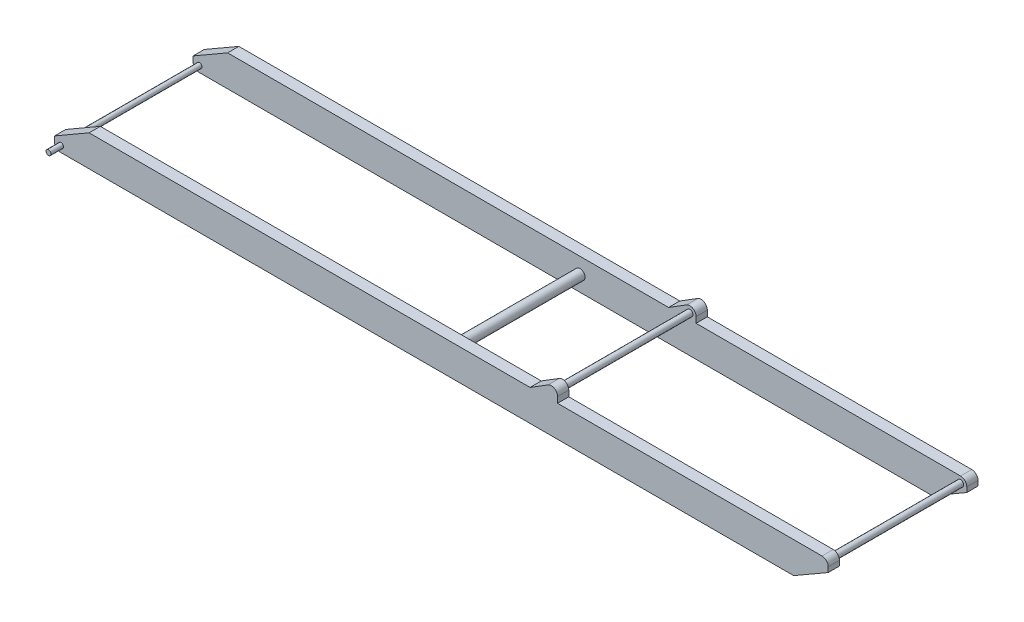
ISO-10303-21;
HEADER;
FILE_DESCRIPTION(('STEP AP214'),'2;1');
FILE_NAME('part.step','',(''),(''),'','','');
FILE_SCHEMA(('AUTOMOTIVE_DESIGN { 1 0 10303 214 1 1 1 1 }'));
ENDSEC;
DATA;
#1=APPLICATION_CONTEXT('core data for automotive mechanical design processes');
#2=APPLICATION_PROTOCOL_DEFINITION('international standard','automotive_design',2000,#1);
#3=PRODUCT_CONTEXT('',#1,'mechanical');
#4=PRODUCT('Part','Part','',(#3));
#5=PRODUCT_RELATED_PRODUCT_CATEGORY('part','',(#4));
#6=PRODUCT_DEFINITION_FORMATION('','',#4);
#7=PRODUCT_DEFINITION_CONTEXT('part definition',#1,'design');
#8=PRODUCT_DEFINITION('design','',#6,#7);
#9=PRODUCT_DEFINITION_SHAPE('','',#8);
#10=(LENGTH_UNIT() NAMED_UNIT(*) SI_UNIT(.MILLI.,.METRE.));
#11=(NAMED_UNIT(*) PLANE_ANGLE_UNIT() SI_UNIT($,.RADIAN.));
#12=(NAMED_UNIT(*) SI_UNIT($,.STERADIAN.) SOLID_ANGLE_UNIT());
#13=UNCERTAINTY_MEASURE_WITH_UNIT(LENGTH_MEASURE(1.E-05),#10,'distance_accuracy_value','');
#14=(GEOMETRIC_REPRESENTATION_CONTEXT(3) GLOBAL_UNCERTAINTY_ASSIGNED_CONTEXT((#13)) GLOBAL_UNIT_ASSIGNED_CONTEXT((#10,
#11,#12)) REPRESENTATION_CONTEXT('',''));
#15=CARTESIAN_POINT('',(0.,0.,0.));
#16=DIRECTION('',(0.,0.,1.));
#17=DIRECTION('',(1.,0.,0.));
#18=AXIS2_PLACEMENT_3D('',#15,#16,#17);
#19=CARTESIAN_POINT('',(0.,50.,600.));
#20=DIRECTION('',(0.,-1.,0.));
#21=DIRECTION('',(1.,0.,0.));
#22=AXIS2_PLACEMENT_3D('',#19,#20,#21);
#23=PLANE('',#22);
#24=DIRECTION('',(-1.,0.,0.));
#25=VECTOR('',#24,1.);
#26=CARTESIAN_POINT('',(-6402.75656984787,49.9999999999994,-510.));
#27=LINE('',#26,#25);
#28=CARTESIAN_POINT('',(-2339.35986036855,49.9999999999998,-510.));
#29=VERTEX_POINT('',#28);
#30=CARTESIAN_POINT('',(-5872.87187078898,49.9999999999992,-510.));
#31=VERTEX_POINT('',#30);
#32=EDGE_CURVE('E357',#29,#31,#27,.T.);
#33=ORIENTED_EDGE('',*,*,#32,.F.);
#34=DIRECTION('',(0.,0.,-1.));
#35=VECTOR('',#34,1.);
#36=CARTESIAN_POINT('',(-2339.35986036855,49.9999999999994,5699.70281092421));
#37=LINE('',#36,#35);
#38=CARTESIAN_POINT('',(-2339.35986036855,49.9999999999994,-600.));
#39=VERTEX_POINT('',#38);
#40=EDGE_CURVE('E50',#29,#39,#37,.T.);
#41=ORIENTED_EDGE('',*,*,#40,.T.);
#42=DIRECTION('',(-1.,0.,0.));
#43=VECTOR('',#42,1.);
#44=CARTESIAN_POINT('',(0.,50.,-600.));
#45=LINE('',#44,#43);
#46=CARTESIAN_POINT('',(-5872.87187078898,49.9999999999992,-600.));
#47=VERTEX_POINT('',#46);
#48=EDGE_CURVE('E387',#39,#47,#45,.T.);
#49=ORIENTED_EDGE('',*,*,#48,.T.);
#50=DIRECTION('',(0.,0.,-1.));
#51=VECTOR('',#50,1.);
#52=CARTESIAN_POINT('',(-5872.87187078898,49.9999999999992,600.));
#53=LINE('',#52,#51);
#54=EDGE_CURVE('E383',#31,#47,#53,.T.);
#55=ORIENTED_EDGE('',*,*,#54,.F.);
#56=EDGE_LOOP('',(#33,#41,#49,#55));
#57=FACE_BOUND('',#56,.T.);
#58=ADVANCED_FACE('F35',(#57),#23,.F.);
#59=CARTESIAN_POINT('',(-2169.08219357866,97.,599.999999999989));
#60=DIRECTION('',(0.,0.,-1.));
#61=DIRECTION('',(-1.,0.,0.));
#62=AXIS2_PLACEMENT_3D('',#59,#60,#61);
#63=CYLINDRICAL_SURFACE('',#62,25.);
#64=CARTESIAN_POINT('',(-2169.08219357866,97.,510.));
#65=DIRECTION('',(0.,0.,1.));
#66=DIRECTION('',(1.,0.,0.));
#67=AXIS2_PLACEMENT_3D('',#64,#65,#66);
#68=CIRCLE('',#67,25.);
#69=CARTESIAN_POINT('',(-2194.08219357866,97.,510.));
#70=VERTEX_POINT('',#69);
#71=EDGE_CURVE('E43',#70,#70,#68,.F.);
#72=CARTESIAN_POINT('',(-2169.08219357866,97.,-510.));
#73=DIRECTION('',(0.,0.,-1.));
#74=DIRECTION('',(-1.,0.,0.));
#75=AXIS2_PLACEMENT_3D('',#72,#73,#74);
#76=CIRCLE('',#75,25.);
#77=CARTESIAN_POINT('',(-2194.08219357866,97.,-510.));
#78=VERTEX_POINT('',#77);
#79=EDGE_CURVE('E11',#78,#78,#76,.T.);
#80=CARTESIAN_POINT('',(-2194.08219357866,97.,510.));
#81=CARTESIAN_POINT('',(-2194.08219357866,97.,499.375));
#82=CARTESIAN_POINT('',(-2194.08219357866,97.,488.75));
#83=CARTESIAN_POINT('',(-2194.08219357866,97.,467.5));
#84=CARTESIAN_POINT('',(-2194.08219357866,97.,456.875));
#85=CARTESIAN_POINT('',(-2194.08219357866,97.,435.625));
#86=CARTESIAN_POINT('',(-2194.08219357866,97.,425.));
#87=CARTESIAN_POINT('',(-2194.08219357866,97.,403.75));
#88=CARTESIAN_POINT('',(-2194.08219357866,97.,393.125));
#89=CARTESIAN_POINT('',(-2194.08219357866,97.,371.875));
#90=CARTESIAN_POINT('',(-2194.08219357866,97.,361.25));
#91=CARTESIAN_POINT('',(-2194.08219357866,97.,340.));
#92=CARTESIAN_POINT('',(-2194.08219357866,97.,329.375));
#93=CARTESIAN_POINT('',(-2194.08219357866,97.,308.125));
#94=CARTESIAN_POINT('',(-2194.08219357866,97.,297.5));
#95=CARTESIAN_POINT('',(-2194.08219357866,97.,276.25));
#96=CARTESIAN_POINT('',(-2194.08219357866,97.,265.625));
#97=CARTESIAN_POINT('',(-2194.08219357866,97.,244.375));
#98=CARTESIAN_POINT('',(-2194.08219357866,97.,233.75));
#99=CARTESIAN_POINT('',(-2194.08219357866,97.,212.5));
#100=CARTESIAN_POINT('',(-2194.08219357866,97.,201.875));
#101=CARTESIAN_POINT('',(-2194.08219357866,97.,180.625));
#102=CARTESIAN_POINT('',(-2194.08219357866,97.,170.));
#103=CARTESIAN_POINT('',(-2194.08219357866,97.,148.75));
#104=CARTESIAN_POINT('',(-2194.08219357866,97.,138.125));
#105=CARTESIAN_POINT('',(-2194.08219357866,97.,116.875));
#106=CARTESIAN_POINT('',(-2194.08219357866,97.,106.25));
#107=CARTESIAN_POINT('',(-2194.08219357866,97.,85.0000000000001));
#108=CARTESIAN_POINT('',(-2194.08219357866,97.,74.3750000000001));
#109=CARTESIAN_POINT('',(-2194.08219357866,97.,53.1250000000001));
#110=CARTESIAN_POINT('',(-2194.08219357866,97.,42.5000000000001));
#111=CARTESIAN_POINT('',(-2194.08219357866,97.,21.2500000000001));
#112=CARTESIAN_POINT('',(-2194.08219357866,97.,10.6250000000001));
#113=CARTESIAN_POINT('',(-2194.08219357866,97.,-10.6249999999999));
#114=CARTESIAN_POINT('',(-2194.08219357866,97.,-21.2499999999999));
#115=CARTESIAN_POINT('',(-2194.08219357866,97.,-42.4999999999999));
#116=CARTESIAN_POINT('',(-2194.08219357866,97.,-53.1249999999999));
#117=CARTESIAN_POINT('',(-2194.08219357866,97.,-74.3749999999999));
#118=CARTESIAN_POINT('',(-2194.08219357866,97.,-84.9999999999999));
#119=CARTESIAN_POINT('',(-2194.08219357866,97.,-106.25));
#120=CARTESIAN_POINT('',(-2194.08219357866,97.,-116.875));
#121=CARTESIAN_POINT('',(-2194.08219357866,97.,-138.125));
#122=CARTESIAN_POINT('',(-2194.08219357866,97.,-148.75));
#123=CARTESIAN_POINT('',(-2194.08219357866,97.,-170.));
#124=CARTESIAN_POINT('',(-2194.08219357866,97.,-180.625));
#125=CARTESIAN_POINT('',(-2194.08219357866,97.,-201.875));
#126=CARTESIAN_POINT('',(-2194.08219357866,97.,-212.5));
#127=CARTESIAN_POINT('',(-2194.08219357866,97.,-233.75));
#128=CARTESIAN_POINT('',(-2194.08219357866,97.,-244.375));
#129=CARTESIAN_POINT('',(-2194.08219357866,97.,-265.625));
#130=CARTESIAN_POINT('',(-2194.08219357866,97.,-276.25));
#131=CARTESIAN_POINT('',(-2194.08219357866,97.,-297.5));
#132=CARTESIAN_POINT('',(-2194.08219357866,97.,-308.125));
#133=CARTESIAN_POINT('',(-2194.08219357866,97.,-329.375));
#134=CARTESIAN_POINT('',(-2194.08219357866,97.,-340.));
#135=CARTESIAN_POINT('',(-2194.08219357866,97.,-361.25));
#136=CARTESIAN_POINT('',(-2194.08219357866,97.,-371.875));
#137=CARTESIAN_POINT('',(-2194.08219357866,97.,-393.125));
#138=CARTESIAN_POINT('',(-2194.08219357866,97.,-403.75));
#139=CARTESIAN_POINT('',(-2194.08219357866,97.,-425.));
#140=CARTESIAN_POINT('',(-2194.08219357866,97.,-435.625));
#141=CARTESIAN_POINT('',(-2194.08219357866,97.,-456.875));
#142=CARTESIAN_POINT('',(-2194.08219357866,97.,-467.5));
#143=CARTESIAN_POINT('',(-2194.08219357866,97.,-488.75));
#144=CARTESIAN_POINT('',(-2194.08219357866,97.,-499.374999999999));
#145=CARTESIAN_POINT('',(-2194.08219357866,97.,-510.));
#146=B_SPLINE_CURVE_WITH_KNOTS('',3,(#80,#81,#82,#83,#84,#85,#86,#87,#88,#89,#90,#91,#92,#93,
#94,#95,#96,#97,#98,#99,#100,#101,#102,#103,#104,#105,#106,#107,#108,#109,#110,#111,#112,#113,
#114,#115,#116,#117,#118,#119,#120,#121,#122,#123,#124,#125,#126,#127,#128,#129,#130,#131,#132,
#133,#134,#135,#136,#137,#138,#139,#140,#141,#142,#143,#144,#145),.UNSPECIFIED.,.F.,.F.,(4,2,2,
2,2,2,2,2,2,2,2,2,2,2,2,2,2,2,2,2,2,2,2,2,2,2,2,2,2,2,2,2,4),(0.,31.8749999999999,
63.7499999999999,95.6249999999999,127.5,159.375,191.25,223.125,255.,286.875,318.75,350.625,
382.5,414.375,446.25,478.125,510.,541.875,573.75,605.625,637.5,669.375,701.25,733.125,765.,
796.875,828.75,860.625,892.5,924.374999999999,956.249999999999,988.124999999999,1020.),.UNSPECIFIED.);
#147=EDGE_CURVE('BSEAM431',#70,#78,#146,.T.);
#148=ORIENTED_EDGE('',*,*,#71,.T.);
#149=ORIENTED_EDGE('',*,*,#79,.F.);
#150=ORIENTED_EDGE('',*,*,#147,.T.);
#151=ORIENTED_EDGE('',*,*,#147,.F.);
#152=EDGE_LOOP('',(#148,#150,#149,#151));
#153=FACE_BOUND('',#152,.T.);
#154=ADVANCED_FACE('F431',(#153),#63,.T.);
#155=CARTESIAN_POINT('',(-6402.75656984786,-200.000000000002,510.));
#156=DIRECTION('',(0.,0.,1.));
#157=DIRECTION('',(1.,0.,0.));
#158=AXIS2_PLACEMENT_3D('',#155,#156,#157);
#159=PLANE('',#158);
#160=CARTESIAN_POINT('',(-3049.07772941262,-75.0000000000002,510.));
#161=DIRECTION('',(0.,0.,1.));
#162=DIRECTION('',(1.,0.,0.));
#163=AXIS2_PLACEMENT_3D('',#160,#161,#162);
#164=CIRCLE('',#163,39.9999999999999);
#165=CARTESIAN_POINT('',(-3089.07772941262,-75.0000000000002,510.));
#166=VERTEX_POINT('',#165);
#167=EDGE_CURVE('E263',#166,#166,#164,.F.);
#168=ORIENTED_EDGE('',*,*,#167,.F.);
#169=EDGE_LOOP('',(#168));
#170=FACE_BOUND('',#169,.T.);
#171=CARTESIAN_POINT('',(0.,0.,510.));
#172=DIRECTION('',(0.,0.,1.));
#173=DIRECTION('',(1.,0.,0.));
#174=AXIS2_PLACEMENT_3D('',#171,#172,#173);
#175=CIRCLE('',#174,25.);
#176=CARTESIAN_POINT('',(-25.,0.,510.));
#177=VERTEX_POINT('',#176);
#178=EDGE_CURVE('E260',#177,#177,#175,.F.);
#179=ORIENTED_EDGE('',*,*,#178,.F.);
#180=EDGE_LOOP('',(#179));
#181=FACE_BOUND('',#180,.T.);
#182=CARTESIAN_POINT('',(-6098.15545882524,-150.000000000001,510.));
#183=DIRECTION('',(0.,0.,1.));
#184=DIRECTION('',(1.,0.,0.));
#185=AXIS2_PLACEMENT_3D('',#182,#183,#184);
#186=CIRCLE('',#185,19.9999999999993);
#187=CARTESIAN_POINT('',(-6118.15545882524,-150.000000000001,510.));
#188=VERTEX_POINT('',#187);
#189=EDGE_CURVE('E408',#188,#188,#186,.T.);
#190=ORIENTED_EDGE('',*,*,#189,.T.);
#191=EDGE_LOOP('',(#190));
#192=FACE_BOUND('',#191,.T.);
#193=DIRECTION('',(0.,-1.,0.));
#194=VECTOR('',#193,1.);
#195=CARTESIAN_POINT('',(-2119.08219357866,97.,510.));
#196=LINE('',#195,#194);
#197=CARTESIAN_POINT('',(-2119.08219357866,97.,510.));
#198=VERTEX_POINT('',#197);
#199=CARTESIAN_POINT('',(-2119.08219357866,49.9999999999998,510.));
#200=VERTEX_POINT('',#199);
#201=EDGE_CURVE('E58',#198,#200,#196,.T.);
#202=ORIENTED_EDGE('',*,*,#201,.T.);
#203=DIRECTION('',(1.,0.,0.));
#204=VECTOR('',#203,1.);
#205=CARTESIAN_POINT('',(-6402.75656984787,49.9999999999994,510.));
#206=LINE('',#205,#204);
#207=CARTESIAN_POINT('',(0.,50.,510.));
#208=VERTEX_POINT('',#207);
#209=EDGE_CURVE('E269',#200,#208,#206,.T.);
#210=ORIENTED_EDGE('',*,*,#209,.T.);
#211=CARTESIAN_POINT('',(0.,0.,510.));
#212=DIRECTION('',(0.,0.,1.));
#213=DIRECTION('',(1.,0.,0.));
#214=AXIS2_PLACEMENT_3D('',#211,#212,#213);
#215=CIRCLE('',#214,50.);
#216=CARTESIAN_POINT('',(50.,2.22044604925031E-13,510.));
#217=VERTEX_POINT('',#216);
#218=EDGE_CURVE('E282',#217,#208,#215,.T.);
#219=ORIENTED_EDGE('',*,*,#218,.F.);
#220=DIRECTION('',(0.,1.,0.));
#221=VECTOR('',#220,1.);
#222=CARTESIAN_POINT('',(50.,2.22044604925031E-13,510.));
#223=LINE('',#222,#221);
#224=CARTESIAN_POINT('',(50.,-40.0000000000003,510.));
#225=VERTEX_POINT('',#224);
#226=EDGE_CURVE('E273',#225,#217,#223,.T.);
#227=ORIENTED_EDGE('',*,*,#226,.F.);
#228=DIRECTION('',(0.866025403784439,0.500000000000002,0.));
#229=VECTOR('',#228,1.);
#230=CARTESIAN_POINT('',(50.,-40.0000000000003,510.));
#231=LINE('',#230,#229);
#232=CARTESIAN_POINT('',(-227.12812921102,-200.000000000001,510.));
#233=VERTEX_POINT('',#232);
#234=EDGE_CURVE('E279',#233,#225,#231,.T.);
#235=ORIENTED_EDGE('',*,*,#234,.F.);
#236=DIRECTION('',(1.,0.,0.));
#237=VECTOR('',#236,1.);
#238=CARTESIAN_POINT('',(-6402.75656984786,-200.000000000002,510.));
#239=LINE('',#238,#237);
#240=CARTESIAN_POINT('',(-6100.00000000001,-200.000000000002,510.));
#241=VERTEX_POINT('',#240);
#242=EDGE_CURVE('E270',#241,#233,#239,.T.);
#243=ORIENTED_EDGE('',*,*,#242,.F.);
#244=CARTESIAN_POINT('',(-6100.00000000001,-150.000000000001,510.));
#245=DIRECTION('',(0.,0.,1.));
#246=DIRECTION('',(1.,0.,0.));
#247=AXIS2_PLACEMENT_3D('',#244,#245,#246);
#248=CIRCLE('',#247,49.9999999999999);
#249=CARTESIAN_POINT('',(-6150.00000000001,-150.000000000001,510.));
#250=VERTEX_POINT('',#249);
#251=EDGE_CURVE('E285',#250,#241,#248,.T.);
#252=ORIENTED_EDGE('',*,*,#251,.F.);
#253=DIRECTION('',(0.,-1.,0.));
#254=VECTOR('',#253,1.);
#255=CARTESIAN_POINT('',(-6150.00000000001,-110.000000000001,510.));
#256=LINE('',#255,#254);
#257=CARTESIAN_POINT('',(-6150.00000000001,-110.000000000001,510.));
#258=VERTEX_POINT('',#257);
#259=EDGE_CURVE('E288',#258,#250,#256,.T.);
#260=ORIENTED_EDGE('',*,*,#259,.F.);
#261=DIRECTION('',(-0.866025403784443,-0.499999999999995,0.));
#262=VECTOR('',#261,1.);
#263=CARTESIAN_POINT('',(-6150.00000000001,-110.000000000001,510.));
#264=LINE('',#263,#262);
#265=CARTESIAN_POINT('',(-5872.87187078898,49.9999999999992,510.));
#266=VERTEX_POINT('',#265);
#267=EDGE_CURVE('E291',#266,#258,#264,.T.);
#268=ORIENTED_EDGE('',*,*,#267,.F.);
#269=CARTESIAN_POINT('',(-2339.35986036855,49.9999999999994,510.));
#270=VERTEX_POINT('',#269);
#271=EDGE_CURVE('E274',#266,#270,#206,.T.);
#272=ORIENTED_EDGE('',*,*,#271,.T.);
#273=DIRECTION('',(0.849219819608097,0.52803948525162,0.));
#274=VECTOR('',#273,1.);
#275=CARTESIAN_POINT('',(-2344.18461217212,46.9999999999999,510.));
#276=LINE('',#275,#274);
#277=CARTESIAN_POINT('',(-2195.48416784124,139.460990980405,510.));
#278=VERTEX_POINT('',#277);
#279=EDGE_CURVE('E241',#270,#278,#276,.T.);
#280=ORIENTED_EDGE('',*,*,#279,.T.);
#281=CARTESIAN_POINT('',(-2169.08219357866,97.,510.));
#282=DIRECTION('',(0.,0.,1.));
#283=DIRECTION('',(1.,0.,0.));
#284=AXIS2_PLACEMENT_3D('',#281,#282,#283);
#285=CIRCLE('',#284,50.0000000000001);
#286=EDGE_CURVE('E238',#278,#198,#285,.F.);
#287=ORIENTED_EDGE('',*,*,#286,.T.);
#288=EDGE_LOOP('',(#202,#210,#219,#227,#235,#243,#252,#260,#268,#272,#280,#287));
#289=FACE_BOUND('',#288,.T.);
#290=ORIENTED_EDGE('',*,*,#71,.F.);
#291=EDGE_LOOP('',(#290));
#292=FACE_BOUND('',#291,.T.);
#293=ADVANCED_FACE('F427',(#170,#181,#192,#289,#292),#159,.F.);
#294=CARTESIAN_POINT('',(0.,50.,600.));
#295=DIRECTION('',(0.,-1.,0.));
#296=DIRECTION('',(1.,0.,0.));
#297=AXIS2_PLACEMENT_3D('',#294,#295,#296);
#298=PLANE('',#297);
#299=ORIENTED_EDGE('',*,*,#209,.F.);
#300=DIRECTION('',(0.,0.,1.));
#301=VECTOR('',#300,1.);
#302=CARTESIAN_POINT('',(-2119.08219357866,49.9999999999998,600.));
#303=LINE('',#302,#301);
#304=CARTESIAN_POINT('',(-2119.08219357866,50.0000000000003,600.));
#305=VERTEX_POINT('',#304);
#306=EDGE_CURVE('E257',#200,#305,#303,.T.);
#307=ORIENTED_EDGE('',*,*,#306,.T.);
#308=DIRECTION('',(-1.,0.,0.));
#309=VECTOR('',#308,1.);
#310=CARTESIAN_POINT('',(0.,50.,600.));
#311=LINE('',#310,#309);
#312=CARTESIAN_POINT('',(0.,50.,600.));
#313=VERTEX_POINT('',#312);
#314=EDGE_CURVE('E301',#313,#305,#311,.T.);
#315=ORIENTED_EDGE('',*,*,#314,.F.);
#316=DIRECTION('',(0.,0.,-1.));
#317=VECTOR('',#316,1.);
#318=CARTESIAN_POINT('',(0.,50.,600.));
#319=LINE('',#318,#317);
#320=EDGE_CURVE('E338',#313,#208,#319,.T.);
#321=ORIENTED_EDGE('',*,*,#320,.T.);
#322=EDGE_LOOP('',(#299,#307,#315,#321));
#323=FACE_BOUND('',#322,.T.);
#324=ADVANCED_FACE('F430',(#323),#298,.F.);
#325=CARTESIAN_POINT('',(-6402.75656984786,-200.000000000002,-510.));
#326=DIRECTION('',(0.,0.,-1.));
#327=DIRECTION('',(-1.,0.,0.));
#328=AXIS2_PLACEMENT_3D('',#325,#326,#327);
#329=PLANE('',#328);
#330=DIRECTION('',(0.,1.,0.));
#331=VECTOR('',#330,1.);
#332=CARTESIAN_POINT('',(-6150.00000000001,-110.000000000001,-510.));
#333=LINE('',#332,#331);
#334=CARTESIAN_POINT('',(-6150.00000000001,-150.000000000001,-510.));
#335=VERTEX_POINT('',#334);
#336=CARTESIAN_POINT('',(-6150.00000000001,-110.000000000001,-510.));
#337=VERTEX_POINT('',#336);
#338=EDGE_CURVE('E382',#335,#337,#333,.T.);
#339=ORIENTED_EDGE('',*,*,#338,.F.);
#340=CARTESIAN_POINT('',(-6100.00000000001,-150.000000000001,-510.));
#341=DIRECTION('',(0.,0.,-1.));
#342=DIRECTION('',(-1.,0.,0.));
#343=AXIS2_PLACEMENT_3D('',#340,#341,#342);
#344=CIRCLE('',#343,49.9999999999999);
#345=CARTESIAN_POINT('',(-6100.00000000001,-200.000000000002,-510.));
#346=VERTEX_POINT('',#345);
#347=EDGE_CURVE('E377',#346,#335,#344,.T.);
#348=ORIENTED_EDGE('',*,*,#347,.F.);
#349=DIRECTION('',(-1.,0.,0.));
#350=VECTOR('',#349,1.);
#351=CARTESIAN_POINT('',(-6402.75656984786,-200.000000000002,-510.));
#352=LINE('',#351,#350);
#353=CARTESIAN_POINT('',(-227.12812921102,-200.000000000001,-510.));
#354=VERTEX_POINT('',#353);
#355=EDGE_CURVE('E372',#354,#346,#352,.T.);
#356=ORIENTED_EDGE('',*,*,#355,.F.);
#357=DIRECTION('',(-0.866025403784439,-0.500000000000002,0.));
#358=VECTOR('',#357,1.);
#359=CARTESIAN_POINT('',(50.,-40.0000000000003,-510.));
#360=LINE('',#359,#358);
#361=CARTESIAN_POINT('',(50.,-40.0000000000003,-510.));
#362=VERTEX_POINT('',#361);
#363=EDGE_CURVE('E367',#362,#354,#360,.T.);
#364=ORIENTED_EDGE('',*,*,#363,.F.);
#365=DIRECTION('',(0.,-1.,0.));
#366=VECTOR('',#365,1.);
#367=CARTESIAN_POINT('',(50.,2.22044604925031E-13,-510.));
#368=LINE('',#367,#366);
#369=CARTESIAN_POINT('',(50.,2.22044604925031E-13,-510.));
#370=VERTEX_POINT('',#369);
#371=EDGE_CURVE('E362',#370,#362,#368,.T.);
#372=ORIENTED_EDGE('',*,*,#371,.F.);
#373=CARTESIAN_POINT('',(0.,0.,-510.));
#374=DIRECTION('',(0.,0.,-1.));
#375=DIRECTION('',(-1.,0.,0.));
#376=AXIS2_PLACEMENT_3D('',#373,#374,#375);
#377=CIRCLE('',#376,50.);
#378=CARTESIAN_POINT('',(0.,50.,-510.));
#379=VERTEX_POINT('',#378);
#380=EDGE_CURVE('E353',#379,#370,#377,.T.);
#381=ORIENTED_EDGE('',*,*,#380,.F.);
#382=CARTESIAN_POINT('',(-2119.08219357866,49.9999999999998,-510.));
#383=VERTEX_POINT('',#382);
#384=EDGE_CURVE('E405',#379,#383,#27,.T.);
#385=ORIENTED_EDGE('',*,*,#384,.T.);
#386=DIRECTION('',(0.,1.,0.));
#387=VECTOR('',#386,1.);
#388=CARTESIAN_POINT('',(-2119.08219357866,97.,-510.));
#389=LINE('',#388,#387);
#390=CARTESIAN_POINT('',(-2119.08219357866,97.,-510.));
#391=VERTEX_POINT('',#390);
#392=EDGE_CURVE('E231',#383,#391,#389,.T.);
#393=ORIENTED_EDGE('',*,*,#392,.T.);
#394=CARTESIAN_POINT('',(-2169.08219357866,97.,-510.));
#395=DIRECTION('',(0.,0.,-1.));
#396=DIRECTION('',(-1.,0.,0.));
#397=AXIS2_PLACEMENT_3D('',#394,#395,#396);
#398=CIRCLE('',#397,50.0000000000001);
#399=CARTESIAN_POINT('',(-2195.48416784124,139.460990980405,-510.));
#400=VERTEX_POINT('',#399);
#401=EDGE_CURVE('E205',#391,#400,#398,.F.);
#402=ORIENTED_EDGE('',*,*,#401,.T.);
#403=DIRECTION('',(-0.849219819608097,-0.528039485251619,0.));
#404=VECTOR('',#403,1.);
#405=CARTESIAN_POINT('',(-2339.35986036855,49.9999999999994,-510.));
#406=LINE('',#405,#404);
#407=EDGE_CURVE('E228',#400,#29,#406,.T.);
#408=ORIENTED_EDGE('',*,*,#407,.T.);
#409=ORIENTED_EDGE('',*,*,#32,.T.);
#410=DIRECTION('',(0.866025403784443,0.499999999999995,0.));
#411=VECTOR('',#410,1.);
#412=CARTESIAN_POINT('',(-6150.00000000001,-110.000000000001,-510.));
#413=LINE('',#412,#411);
#414=EDGE_CURVE('E386',#337,#31,#413,.T.);
#415=ORIENTED_EDGE('',*,*,#414,.F.);
#416=EDGE_LOOP('',(#339,#348,#356,#364,#372,#381,#385,#393,#402,#408,#409,#415));
#417=FACE_BOUND('',#416,.T.);
#418=CARTESIAN_POINT('',(-6098.15545882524,-150.000000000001,-510.));
#419=DIRECTION('',(0.,0.,-1.));
#420=DIRECTION('',(-1.,0.,0.));
#421=AXIS2_PLACEMENT_3D('',#418,#419,#420);
#422=CIRCLE('',#421,19.9999999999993);
#423=CARTESIAN_POINT('',(-6118.15545882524,-150.000000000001,-510.));
#424=VERTEX_POINT('',#423);
#425=EDGE_CURVE('E345',#424,#424,#422,.F.);
#426=ORIENTED_EDGE('',*,*,#425,.F.);
#427=EDGE_LOOP('',(#426));
#428=FACE_BOUND('',#427,.T.);
#429=CARTESIAN_POINT('',(0.,0.,-510.));
#430=DIRECTION('',(0.,0.,-1.));
#431=DIRECTION('',(-1.,0.,0.));
#432=AXIS2_PLACEMENT_3D('',#429,#430,#431);
#433=CIRCLE('',#432,25.);
#434=CARTESIAN_POINT('',(-25.,0.,-509.999999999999));
#435=VERTEX_POINT('',#434);
#436=EDGE_CURVE('E266',#435,#435,#433,.F.);
#437=ORIENTED_EDGE('',*,*,#436,.F.);
#438=EDGE_LOOP('',(#437));
#439=FACE_BOUND('',#438,.T.);
#440=CARTESIAN_POINT('',(-3049.07772941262,-75.0000000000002,-510.));
#441=DIRECTION('',(0.,0.,-1.));
#442=DIRECTION('',(-1.,0.,0.));
#443=AXIS2_PLACEMENT_3D('',#440,#441,#442);
#444=CIRCLE('',#443,39.9999999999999);
#445=CARTESIAN_POINT('',(-3089.07772941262,-75.0000000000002,-509.999999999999));
#446=VERTEX_POINT('',#445);
#447=EDGE_CURVE('E236',#446,#446,#444,.F.);
#448=ORIENTED_EDGE('',*,*,#447,.F.);
#449=EDGE_LOOP('',(#448));
#450=FACE_BOUND('',#449,.T.);
#451=ORIENTED_EDGE('',*,*,#79,.T.);
#452=EDGE_LOOP('',(#451));
#453=FACE_BOUND('',#452,.T.);
#454=ADVANCED_FACE('F444',(#417,#428,#439,#450,#453),#329,.F.);
#455=CARTESIAN_POINT('',(-6098.15545882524,-150.000000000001,700.));
#456=DIRECTION('',(0.,0.,-1.));
#457=DIRECTION('',(-1.,0.,0.));
#458=AXIS2_PLACEMENT_3D('',#455,#456,#457);
#459=CYLINDRICAL_SURFACE('',#458,19.9999999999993);
#460=CARTESIAN_POINT('',(-6118.15545882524,-150.000000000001,-510.));
#461=CARTESIAN_POINT('',(-6118.15545882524,-150.000000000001,-499.375));
#462=CARTESIAN_POINT('',(-6118.15545882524,-150.000000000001,-488.75));
#463=CARTESIAN_POINT('',(-6118.15545882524,-150.000000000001,-467.5));
#464=CARTESIAN_POINT('',(-6118.15545882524,-150.000000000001,-456.875));
#465=CARTESIAN_POINT('',(-6118.15545882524,-150.000000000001,-435.625));
#466=CARTESIAN_POINT('',(-6118.15545882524,-150.000000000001,-425.));
#467=CARTESIAN_POINT('',(-6118.15545882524,-150.000000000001,-403.75));
#468=CARTESIAN_POINT('',(-6118.15545882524,-150.000000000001,-393.125));
#469=CARTESIAN_POINT('',(-6118.15545882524,-150.000000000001,-371.875));
#470=CARTESIAN_POINT('',(-6118.15545882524,-150.000000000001,-361.25));
#471=CARTESIAN_POINT('',(-6118.15545882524,-150.000000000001,-340.));
#472=CARTESIAN_POINT('',(-6118.15545882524,-150.000000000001,-329.375));
#473=CARTESIAN_POINT('',(-6118.15545882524,-150.000000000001,-308.125));
#474=CARTESIAN_POINT('',(-6118.15545882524,-150.000000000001,-297.5));
#475=CARTESIAN_POINT('',(-6118.15545882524,-150.000000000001,-276.25));
#476=CARTESIAN_POINT('',(-6118.15545882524,-150.000000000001,-265.625));
#477=CARTESIAN_POINT('',(-6118.15545882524,-150.000000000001,-244.375));
#478=CARTESIAN_POINT('',(-6118.15545882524,-150.000000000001,-233.75));
#479=CARTESIAN_POINT('',(-6118.15545882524,-150.000000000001,-212.5));
#480=CARTESIAN_POINT('',(-6118.15545882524,-150.000000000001,-201.875));
#481=CARTESIAN_POINT('',(-6118.15545882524,-150.000000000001,-180.625));
#482=CARTESIAN_POINT('',(-6118.15545882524,-150.000000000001,-170.));
#483=CARTESIAN_POINT('',(-6118.15545882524,-150.000000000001,-148.75));
#484=CARTESIAN_POINT('',(-6118.15545882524,-150.000000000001,-138.125));
#485=CARTESIAN_POINT('',(-6118.15545882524,-150.000000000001,-116.875));
#486=CARTESIAN_POINT('',(-6118.15545882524,-150.000000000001,-106.25));
#487=CARTESIAN_POINT('',(-6118.15545882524,-150.000000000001,-84.9999999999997));
#488=CARTESIAN_POINT('',(-6118.15545882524,-150.000000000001,-74.3749999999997));
#489=CARTESIAN_POINT('',(-6118.15545882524,-150.000000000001,-53.1249999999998));
#490=CARTESIAN_POINT('',(-6118.15545882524,-150.000000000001,-42.4999999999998));
#491=CARTESIAN_POINT('',(-6118.15545882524,-150.000000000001,-21.2499999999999));
#492=CARTESIAN_POINT('',(-6118.15545882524,-150.000000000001,-10.6249999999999));
#493=CARTESIAN_POINT('',(-6118.15545882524,-150.000000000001,10.6250000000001));
#494=CARTESIAN_POINT('',(-6118.15545882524,-150.000000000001,21.2500000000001));
#495=CARTESIAN_POINT('',(-6118.15545882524,-150.000000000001,42.5000000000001));
#496=CARTESIAN_POINT('',(-6118.15545882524,-150.000000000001,53.1250000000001));
#497=CARTESIAN_POINT('',(-6118.15545882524,-150.000000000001,74.3750000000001));
#498=CARTESIAN_POINT('',(-6118.15545882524,-150.000000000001,85.0000000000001));
#499=CARTESIAN_POINT('',(-6118.15545882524,-150.000000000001,106.25));
#500=CARTESIAN_POINT('',(-6118.15545882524,-150.000000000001,116.875));
#501=CARTESIAN_POINT('',(-6118.15545882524,-150.000000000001,138.125));
#502=CARTESIAN_POINT('',(-6118.15545882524,-150.000000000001,148.75));
#503=CARTESIAN_POINT('',(-6118.15545882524,-150.000000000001,170.));
#504=CARTESIAN_POINT('',(-6118.15545882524,-150.000000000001,180.625));
#505=CARTESIAN_POINT('',(-6118.15545882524,-150.000000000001,201.875));
#506=CARTESIAN_POINT('',(-6118.15545882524,-150.000000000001,212.5));
#507=CARTESIAN_POINT('',(-6118.15545882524,-150.000000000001,233.75));
#508=CARTESIAN_POINT('',(-6118.15545882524,-150.000000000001,244.375));
#509=CARTESIAN_POINT('',(-6118.15545882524,-150.000000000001,265.625));
#510=CARTESIAN_POINT('',(-6118.15545882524,-150.000000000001,276.25));
#511=CARTESIAN_POINT('',(-6118.15545882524,-150.000000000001,297.5));
#512=CARTESIAN_POINT('',(-6118.15545882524,-150.000000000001,308.125));
#513=CARTESIAN_POINT('',(-6118.15545882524,-150.000000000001,329.375));
#514=CARTESIAN_POINT('',(-6118.15545882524,-150.000000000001,340.));
#515=CARTESIAN_POINT('',(-6118.15545882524,-150.000000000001,361.25));
#516=CARTESIAN_POINT('',(-6118.15545882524,-150.000000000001,371.875));
#517=CARTESIAN_POINT('',(-6118.15545882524,-150.000000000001,393.125));
#518=CARTESIAN_POINT('',(-6118.15545882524,-150.000000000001,403.75));
#519=CARTESIAN_POINT('',(-6118.15545882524,-150.000000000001,425.));
#520=CARTESIAN_POINT('',(-6118.15545882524,-150.000000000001,435.625));
#521=CARTESIAN_POINT('',(-6118.15545882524,-150.000000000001,456.875));
#522=CARTESIAN_POINT('',(-6118.15545882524,-150.000000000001,467.5));
#523=CARTESIAN_POINT('',(-6118.15545882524,-150.000000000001,488.75));
#524=CARTESIAN_POINT('',(-6118.15545882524,-150.000000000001,499.375));
#525=CARTESIAN_POINT('',(-6118.15545882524,-150.000000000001,510.));
#526=B_SPLINE_CURVE_WITH_KNOTS('',3,(#460,#461,#462,#463,#464,#465,#466,#467,#468,#469,#470,
#471,#472,#473,#474,#475,#476,#477,#478,#479,#480,#481,#482,#483,#484,#485,#486,#487,#488,#489,
#490,#491,#492,#493,#494,#495,#496,#497,#498,#499,#500,#501,#502,#503,#504,#505,#506,#507,#508,
#509,#510,#511,#512,#513,#514,#515,#516,#517,#518,#519,#520,#521,#522,#523,#524,#525),
.UNSPECIFIED.,.F.,.F.,(4,2,2,2,2,2,2,2,2,2,2,2,2,2,2,2,2,2,2,2,2,2,2,2,2,2,2,2,2,2,2,2,4),(0.,
31.8749999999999,63.75,95.6250000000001,127.5,159.375,191.25,223.125,255.,286.875,318.75,
350.625,382.5,414.375,446.25,478.125,510.,541.875,573.75,605.625,637.5,669.375,701.25,733.125,
765.,796.875,828.75,860.625,892.5,924.375,956.25,988.124999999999,1020.),.UNSPECIFIED.);
#527=EDGE_CURVE('BSEAM446',#424,#188,#526,.T.);
#528=ORIENTED_EDGE('',*,*,#425,.T.);
#529=ORIENTED_EDGE('',*,*,#189,.F.);
#530=ORIENTED_EDGE('',*,*,#527,.T.);
#531=ORIENTED_EDGE('',*,*,#527,.F.);
#532=EDGE_LOOP('',(#528,#530,#529,#531));
#533=FACE_BOUND('',#532,.T.);
#534=ADVANCED_FACE('F446',(#533),#459,.T.);
#535=CARTESIAN_POINT('',(0.,0.,600.));
#536=DIRECTION('',(0.,0.,-1.));
#537=DIRECTION('',(-1.,0.,0.));
#538=AXIS2_PLACEMENT_3D('',#535,#536,#537);
#539=CYLINDRICAL_SURFACE('',#538,50.);
#540=DIRECTION('',(0.,0.,-1.));
#541=VECTOR('',#540,1.);
#542=CARTESIAN_POINT('',(0.,50.,600.));
#543=LINE('',#542,#541);
#544=CARTESIAN_POINT('',(0.,50.,-600.));
#545=VERTEX_POINT('',#544);
#546=EDGE_CURVE('E391',#379,#545,#543,.T.);
#547=ORIENTED_EDGE('',*,*,#546,.F.);
#548=ORIENTED_EDGE('',*,*,#380,.T.);
#549=DIRECTION('',(0.,0.,-1.));
#550=VECTOR('',#549,1.);
#551=CARTESIAN_POINT('',(50.,2.22044604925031E-13,600.));
#552=LINE('',#551,#550);
#553=CARTESIAN_POINT('',(50.,2.22044604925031E-13,-600.));
#554=VERTEX_POINT('',#553);
#555=EDGE_CURVE('E392',#370,#554,#552,.T.);
#556=ORIENTED_EDGE('',*,*,#555,.T.);
#557=CARTESIAN_POINT('',(0.,0.,-600.));
#558=DIRECTION('',(0.,0.,1.));
#559=DIRECTION('',(1.,0.,0.));
#560=AXIS2_PLACEMENT_3D('',#557,#558,#559);
#561=CIRCLE('',#560,50.);
#562=EDGE_CURVE('E388',#554,#545,#561,.T.);
#563=ORIENTED_EDGE('',*,*,#562,.T.);
#564=EDGE_LOOP('',(#547,#548,#556,#563));
#565=FACE_BOUND('',#564,.T.);
#566=ADVANCED_FACE('F37',(#565),#539,.T.);
#567=CARTESIAN_POINT('',(-2119.08219357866,49.9999999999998,-600.));
#568=VERTEX_POINT('',#567);
#569=EDGE_CURVE('E384',#545,#568,#45,.T.);
#570=ORIENTED_EDGE('',*,*,#569,.T.);
#571=DIRECTION('',(0.,0.,-1.));
#572=VECTOR('',#571,1.);
#573=CARTESIAN_POINT('',(-2119.08219357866,49.9999999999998,5699.70281092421));
#574=LINE('',#573,#572);
#575=EDGE_CURVE('E207',#383,#568,#574,.T.);
#576=ORIENTED_EDGE('',*,*,#575,.F.);
#577=ORIENTED_EDGE('',*,*,#384,.F.);
#578=ORIENTED_EDGE('',*,*,#546,.T.);
#579=EDGE_LOOP('',(#570,#576,#577,#578));
#580=FACE_BOUND('',#579,.T.);
#581=ADVANCED_FACE('F465',(#580),#23,.F.);
#582=CARTESIAN_POINT('',(-6150.00000000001,-110.000000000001,600.));
#583=DIRECTION('',(0.499999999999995,-0.866025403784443,0.));
#584=DIRECTION('',(0.866025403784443,0.499999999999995,0.));
#585=AXIS2_PLACEMENT_3D('',#582,#583,#584);
#586=PLANE('',#585);
#587=DIRECTION('',(0.,0.,-1.));
#588=VECTOR('',#587,1.);
#589=CARTESIAN_POINT('',(-6150.00000000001,-110.000000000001,600.));
#590=LINE('',#589,#588);
#591=CARTESIAN_POINT('',(-6150.00000000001,-110.000000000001,-600.));
#592=VERTEX_POINT('',#591);
#593=EDGE_CURVE('E378',#337,#592,#590,.T.);
#594=ORIENTED_EDGE('',*,*,#593,.F.);
#595=ORIENTED_EDGE('',*,*,#414,.T.);
#596=ORIENTED_EDGE('',*,*,#54,.T.);
#597=DIRECTION('',(-0.866025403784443,-0.499999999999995,0.));
#598=VECTOR('',#597,1.);
#599=CARTESIAN_POINT('',(-6150.00000000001,-110.000000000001,-600.));
#600=LINE('',#599,#598);
#601=EDGE_CURVE('E379',#47,#592,#600,.T.);
#602=ORIENTED_EDGE('',*,*,#601,.T.);
#603=EDGE_LOOP('',(#594,#595,#596,#602));
#604=FACE_BOUND('',#603,.T.);
#605=ADVANCED_FACE('F471',(#604),#586,.F.);
#606=CARTESIAN_POINT('',(-6150.00000000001,-110.000000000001,600.));
#607=DIRECTION('',(1.,0.,0.));
#608=DIRECTION('',(0.,0.,-1.));
#609=AXIS2_PLACEMENT_3D('',#606,#607,#608);
#610=PLANE('',#609);
#611=DIRECTION('',(0.,0.,-1.));
#612=VECTOR('',#611,1.);
#613=CARTESIAN_POINT('',(-6150.00000000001,-150.000000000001,600.));
#614=LINE('',#613,#612);
#615=CARTESIAN_POINT('',(-6150.00000000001,-150.000000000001,-600.));
#616=VERTEX_POINT('',#615);
#617=EDGE_CURVE('E373',#335,#616,#614,.T.);
#618=ORIENTED_EDGE('',*,*,#617,.F.);
#619=ORIENTED_EDGE('',*,*,#338,.T.);
#620=ORIENTED_EDGE('',*,*,#593,.T.);
#621=DIRECTION('',(0.,-1.,0.));
#622=VECTOR('',#621,1.);
#623=CARTESIAN_POINT('',(-6150.00000000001,-110.000000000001,-600.));
#624=LINE('',#623,#622);
#625=EDGE_CURVE('E374',#592,#616,#624,.T.);
#626=ORIENTED_EDGE('',*,*,#625,.T.);
#627=EDGE_LOOP('',(#618,#619,#620,#626));
#628=FACE_BOUND('',#627,.T.);
#629=ADVANCED_FACE('F477',(#628),#610,.F.);
#630=CARTESIAN_POINT('',(-6100.00000000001,-150.000000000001,600.));
#631=DIRECTION('',(0.,0.,-1.));
#632=DIRECTION('',(-1.,0.,0.));
#633=AXIS2_PLACEMENT_3D('',#630,#631,#632);
#634=CYLINDRICAL_SURFACE('',#633,49.9999999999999);
#635=DIRECTION('',(0.,0.,-1.));
#636=VECTOR('',#635,1.);
#637=CARTESIAN_POINT('',(-6100.00000000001,-200.000000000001,600.));
#638=LINE('',#637,#636);
#639=CARTESIAN_POINT('',(-6100.00000000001,-200.000000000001,-600.));
#640=VERTEX_POINT('',#639);
#641=EDGE_CURVE('E368',#346,#640,#638,.T.);
#642=ORIENTED_EDGE('',*,*,#641,.F.);
#643=ORIENTED_EDGE('',*,*,#347,.T.);
#644=ORIENTED_EDGE('',*,*,#617,.T.);
#645=CARTESIAN_POINT('',(-6100.00000000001,-150.000000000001,-600.));
#646=DIRECTION('',(0.,0.,1.));
#647=DIRECTION('',(-1.,0.,0.));
#648=AXIS2_PLACEMENT_3D('',#645,#646,#647);
#649=CIRCLE('',#648,49.9999999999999);
#650=EDGE_CURVE('E369',#616,#640,#649,.T.);
#651=ORIENTED_EDGE('',*,*,#650,.T.);
#652=EDGE_LOOP('',(#642,#643,#644,#651));
#653=FACE_BOUND('',#652,.T.);
#654=ADVANCED_FACE('F497',(#653),#634,.T.);
#655=CARTESIAN_POINT('',(-227.12812921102,-200.,600.));
#656=DIRECTION('',(0.,1.,0.));
#657=DIRECTION('',(-1.,0.,0.));
#658=AXIS2_PLACEMENT_3D('',#655,#656,#657);
#659=PLANE('',#658);
#660=DIRECTION('',(0.,0.,-1.));
#661=VECTOR('',#660,1.);
#662=CARTESIAN_POINT('',(-227.12812921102,-200.,600.));
#663=LINE('',#662,#661);
#664=CARTESIAN_POINT('',(-227.12812921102,-200.,-600.));
#665=VERTEX_POINT('',#664);
#666=EDGE_CURVE('E363',#354,#665,#663,.T.);
#667=ORIENTED_EDGE('',*,*,#666,.F.);
#668=ORIENTED_EDGE('',*,*,#355,.T.);
#669=ORIENTED_EDGE('',*,*,#641,.T.);
#670=DIRECTION('',(1.,0.,0.));
#671=VECTOR('',#670,1.);
#672=CARTESIAN_POINT('',(-227.12812921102,-200.,-600.));
#673=LINE('',#672,#671);
#674=EDGE_CURVE('E364',#640,#665,#673,.T.);
#675=ORIENTED_EDGE('',*,*,#674,.T.);
#676=EDGE_LOOP('',(#667,#668,#669,#675));
#677=FACE_BOUND('',#676,.T.);
#678=ADVANCED_FACE('F494',(#677),#659,.F.);
#679=CARTESIAN_POINT('',(50.,-40.0000000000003,600.));
#680=DIRECTION('',(-0.500000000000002,0.866025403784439,0.));
#681=DIRECTION('',(-0.866025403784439,-0.500000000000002,0.));
#682=AXIS2_PLACEMENT_3D('',#679,#680,#681);
#683=PLANE('',#682);
#684=DIRECTION('',(0.,0.,-1.));
#685=VECTOR('',#684,1.);
#686=CARTESIAN_POINT('',(50.,-40.0000000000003,600.));
#687=LINE('',#686,#685);
#688=CARTESIAN_POINT('',(50.,-40.0000000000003,-600.));
#689=VERTEX_POINT('',#688);
#690=EDGE_CURVE('E358',#362,#689,#687,.T.);
#691=ORIENTED_EDGE('',*,*,#690,.F.);
#692=ORIENTED_EDGE('',*,*,#363,.T.);
#693=ORIENTED_EDGE('',*,*,#666,.T.);
#694=DIRECTION('',(0.866025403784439,0.500000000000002,0.));
#695=VECTOR('',#694,1.);
#696=CARTESIAN_POINT('',(50.,-40.0000000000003,-600.));
#697=LINE('',#696,#695);
#698=EDGE_CURVE('E359',#665,#689,#697,.T.);
#699=ORIENTED_EDGE('',*,*,#698,.T.);
#700=EDGE_LOOP('',(#691,#692,#693,#699));
#701=FACE_BOUND('',#700,.T.);
#702=ADVANCED_FACE('F491',(#701),#683,.F.);
#703=CARTESIAN_POINT('',(50.,2.22044604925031E-13,600.));
#704=DIRECTION('',(-1.,0.,0.));
#705=DIRECTION('',(0.,0.,1.));
#706=AXIS2_PLACEMENT_3D('',#703,#704,#705);
#707=PLANE('',#706);
#708=ORIENTED_EDGE('',*,*,#555,.F.);
#709=ORIENTED_EDGE('',*,*,#371,.T.);
#710=ORIENTED_EDGE('',*,*,#690,.T.);
#711=DIRECTION('',(0.,1.,0.));
#712=VECTOR('',#711,1.);
#713=CARTESIAN_POINT('',(50.,2.22044604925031E-13,-600.));
#714=LINE('',#713,#712);
#715=EDGE_CURVE('E354',#689,#554,#714,.T.);
#716=ORIENTED_EDGE('',*,*,#715,.T.);
#717=EDGE_LOOP('',(#708,#709,#710,#716));
#718=FACE_BOUND('',#717,.T.);
#719=ADVANCED_FACE('F485',(#718),#707,.F.);
#720=CARTESIAN_POINT('',(0.,0.,-600.));
#721=DIRECTION('',(0.,0.,1.));
#722=DIRECTION('',(1.,0.,0.));
#723=AXIS2_PLACEMENT_3D('',#720,#721,#722);
#724=PLANE('',#723);
#725=CARTESIAN_POINT('',(-6098.15545882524,-150.000000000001,-600.));
#726=DIRECTION('',(0.,0.,1.));
#727=DIRECTION('',(1.,0.,0.));
#728=AXIS2_PLACEMENT_3D('',#725,#726,#727);
#729=CIRCLE('',#728,19.9999999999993);
#730=CARTESIAN_POINT('',(-6118.15545882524,-150.000000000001,-599.999999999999));
#731=VERTEX_POINT('',#730);
#732=EDGE_CURVE('E350',#731,#731,#729,.F.);
#733=ORIENTED_EDGE('',*,*,#732,.F.);
#734=EDGE_LOOP('',(#733));
#735=FACE_BOUND('',#734,.T.);
#736=ORIENTED_EDGE('',*,*,#562,.F.);
#737=ORIENTED_EDGE('',*,*,#715,.F.);
#738=ORIENTED_EDGE('',*,*,#698,.F.);
#739=ORIENTED_EDGE('',*,*,#674,.F.);
#740=ORIENTED_EDGE('',*,*,#650,.F.);
#741=ORIENTED_EDGE('',*,*,#625,.F.);
#742=ORIENTED_EDGE('',*,*,#601,.F.);
#743=ORIENTED_EDGE('',*,*,#48,.F.);
#744=DIRECTION('',(0.849219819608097,0.528039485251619,0.));
#745=VECTOR('',#744,1.);
#746=CARTESIAN_POINT('',(-2339.35986036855,49.9999999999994,-600.));
#747=LINE('',#746,#745);
#748=CARTESIAN_POINT('',(-2195.48416784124,139.460990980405,-600.));
#749=VERTEX_POINT('',#748);
#750=EDGE_CURVE('E208',#39,#749,#747,.T.);
#751=ORIENTED_EDGE('',*,*,#750,.T.);
#752=CARTESIAN_POINT('',(-2169.08219357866,97.,-600.));
#753=DIRECTION('',(0.,0.,-1.));
#754=DIRECTION('',(-1.,0.,0.));
#755=AXIS2_PLACEMENT_3D('',#752,#753,#754);
#756=CIRCLE('',#755,50.0000000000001);
#757=CARTESIAN_POINT('',(-2119.08219357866,97.,-600.));
#758=VERTEX_POINT('',#757);
#759=EDGE_CURVE('E203',#749,#758,#756,.T.);
#760=ORIENTED_EDGE('',*,*,#759,.T.);
#761=DIRECTION('',(0.,-1.,0.));
#762=VECTOR('',#761,1.);
#763=CARTESIAN_POINT('',(-2119.08219357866,97.,-600.));
#764=LINE('',#763,#762);
#765=EDGE_CURVE('E211',#758,#568,#764,.T.);
#766=ORIENTED_EDGE('',*,*,#765,.T.);
#767=ORIENTED_EDGE('',*,*,#569,.F.);
#768=EDGE_LOOP('',(#736,#737,#738,#739,#740,#741,#742,#743,#751,#760,#766,#767));
#769=FACE_BOUND('',#768,.T.);
#770=ADVANCED_FACE('F219',(#735,#769),#724,.F.);
#771=CARTESIAN_POINT('',(-6098.15545882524,-150.000000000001,-700.));
#772=DIRECTION('',(0.,0.,1.));
#773=DIRECTION('',(1.,0.,0.));
#774=AXIS2_PLACEMENT_3D('',#771,#772,#773);
#775=CIRCLE('',#774,19.9999999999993);
#776=CARTESIAN_POINT('',(-6118.15545882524,-150.000000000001,-700.));
#777=VERTEX_POINT('',#776);
#778=EDGE_CURVE('E341',#777,#777,#775,.T.);
#779=CARTESIAN_POINT('',(-6118.15545882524,-150.000000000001,-700.));
#780=CARTESIAN_POINT('',(-6118.15545882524,-150.000000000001,-698.958333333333));
#781=CARTESIAN_POINT('',(-6118.15545882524,-150.000000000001,-697.916666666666));
#782=CARTESIAN_POINT('',(-6118.15545882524,-150.000000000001,-695.833333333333));
#783=CARTESIAN_POINT('',(-6118.15545882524,-150.000000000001,-694.791666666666));
#784=CARTESIAN_POINT('',(-6118.15545882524,-150.000000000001,-692.708333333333));
#785=CARTESIAN_POINT('',(-6118.15545882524,-150.000000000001,-691.666666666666));
#786=CARTESIAN_POINT('',(-6118.15545882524,-150.000000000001,-689.583333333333));
#787=CARTESIAN_POINT('',(-6118.15545882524,-150.000000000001,-688.541666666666));
#788=CARTESIAN_POINT('',(-6118.15545882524,-150.000000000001,-686.458333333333));
#789=CARTESIAN_POINT('',(-6118.15545882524,-150.000000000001,-685.416666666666));
#790=CARTESIAN_POINT('',(-6118.15545882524,-150.000000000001,-683.333333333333));
#791=CARTESIAN_POINT('',(-6118.15545882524,-150.000000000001,-682.291666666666));
#792=CARTESIAN_POINT('',(-6118.15545882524,-150.000000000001,-680.208333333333));
#793=CARTESIAN_POINT('',(-6118.15545882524,-150.000000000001,-679.166666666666));
#794=CARTESIAN_POINT('',(-6118.15545882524,-150.000000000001,-677.083333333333));
#795=CARTESIAN_POINT('',(-6118.15545882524,-150.000000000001,-676.041666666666));
#796=CARTESIAN_POINT('',(-6118.15545882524,-150.000000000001,-673.958333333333));
#797=CARTESIAN_POINT('',(-6118.15545882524,-150.000000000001,-672.916666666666));
#798=CARTESIAN_POINT('',(-6118.15545882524,-150.000000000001,-670.833333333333));
#799=CARTESIAN_POINT('',(-6118.15545882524,-150.000000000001,-669.791666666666));
#800=CARTESIAN_POINT('',(-6118.15545882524,-150.000000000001,-667.708333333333));
#801=CARTESIAN_POINT('',(-6118.15545882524,-150.000000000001,-666.666666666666));
#802=CARTESIAN_POINT('',(-6118.15545882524,-150.000000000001,-664.583333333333));
#803=CARTESIAN_POINT('',(-6118.15545882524,-150.000000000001,-663.541666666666));
#804=CARTESIAN_POINT('',(-6118.15545882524,-150.000000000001,-661.458333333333));
#805=CARTESIAN_POINT('',(-6118.15545882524,-150.000000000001,-660.416666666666));
#806=CARTESIAN_POINT('',(-6118.15545882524,-150.000000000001,-658.333333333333));
#807=CARTESIAN_POINT('',(-6118.15545882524,-150.000000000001,-657.291666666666));
#808=CARTESIAN_POINT('',(-6118.15545882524,-150.000000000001,-655.208333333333));
#809=CARTESIAN_POINT('',(-6118.15545882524,-150.000000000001,-654.166666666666));
#810=CARTESIAN_POINT('',(-6118.15545882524,-150.000000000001,-652.083333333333));
#811=CARTESIAN_POINT('',(-6118.15545882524,-150.000000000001,-651.041666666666));
#812=CARTESIAN_POINT('',(-6118.15545882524,-150.000000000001,-648.958333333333));
#813=CARTESIAN_POINT('',(-6118.15545882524,-150.000000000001,-647.916666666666));
#814=CARTESIAN_POINT('',(-6118.15545882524,-150.000000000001,-645.833333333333));
#815=CARTESIAN_POINT('',(-6118.15545882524,-150.000000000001,-644.791666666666));
#816=CARTESIAN_POINT('',(-6118.15545882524,-150.000000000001,-642.708333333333));
#817=CARTESIAN_POINT('',(-6118.15545882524,-150.000000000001,-641.666666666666));
#818=CARTESIAN_POINT('',(-6118.15545882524,-150.000000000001,-639.583333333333));
#819=CARTESIAN_POINT('',(-6118.15545882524,-150.000000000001,-638.541666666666));
#820=CARTESIAN_POINT('',(-6118.15545882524,-150.000000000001,-636.458333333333));
#821=CARTESIAN_POINT('',(-6118.15545882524,-150.000000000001,-635.416666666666));
#822=CARTESIAN_POINT('',(-6118.15545882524,-150.000000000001,-633.333333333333));
#823=CARTESIAN_POINT('',(-6118.15545882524,-150.000000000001,-632.291666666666));
#824=CARTESIAN_POINT('',(-6118.15545882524,-150.000000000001,-630.208333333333));
#825=CARTESIAN_POINT('',(-6118.15545882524,-150.000000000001,-629.166666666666));
#826=CARTESIAN_POINT('',(-6118.15545882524,-150.000000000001,-627.083333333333));
#827=CARTESIAN_POINT('',(-6118.15545882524,-150.000000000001,-626.041666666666));
#828=CARTESIAN_POINT('',(-6118.15545882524,-150.000000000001,-623.958333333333));
#829=CARTESIAN_POINT('',(-6118.15545882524,-150.000000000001,-622.916666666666));
#830=CARTESIAN_POINT('',(-6118.15545882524,-150.000000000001,-620.833333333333));
#831=CARTESIAN_POINT('',(-6118.15545882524,-150.000000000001,-619.791666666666));
#832=CARTESIAN_POINT('',(-6118.15545882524,-150.000000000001,-617.708333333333));
#833=CARTESIAN_POINT('',(-6118.15545882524,-150.000000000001,-616.666666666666));
#834=CARTESIAN_POINT('',(-6118.15545882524,-150.000000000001,-614.583333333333));
#835=CARTESIAN_POINT('',(-6118.15545882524,-150.000000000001,-613.541666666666));
#836=CARTESIAN_POINT('',(-6118.15545882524,-150.000000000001,-611.458333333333));
#837=CARTESIAN_POINT('',(-6118.15545882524,-150.000000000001,-610.416666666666));
#838=CARTESIAN_POINT('',(-6118.15545882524,-150.000000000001,-608.333333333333));
#839=CARTESIAN_POINT('',(-6118.15545882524,-150.000000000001,-607.291666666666));
#840=CARTESIAN_POINT('',(-6118.15545882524,-150.000000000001,-605.208333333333));
#841=CARTESIAN_POINT('',(-6118.15545882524,-150.000000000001,-604.166666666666));
#842=CARTESIAN_POINT('',(-6118.15545882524,-150.000000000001,-602.083333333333));
#843=CARTESIAN_POINT('',(-6118.15545882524,-150.000000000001,-601.041666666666));
#844=CARTESIAN_POINT('',(-6118.15545882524,-150.000000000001,-599.999999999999));
#845=B_SPLINE_CURVE_WITH_KNOTS('',3,(#779,#780,#781,#782,#783,#784,#785,#786,#787,#788,#789,
#790,#791,#792,#793,#794,#795,#796,#797,#798,#799,#800,#801,#802,#803,#804,#805,#806,#807,#808,
#809,#810,#811,#812,#813,#814,#815,#816,#817,#818,#819,#820,#821,#822,#823,#824,#825,#826,#827,
#828,#829,#830,#831,#832,#833,#834,#835,#836,#837,#838,#839,#840,#841,#842,#843,#844),
.UNSPECIFIED.,.F.,.F.,(4,2,2,2,2,2,2,2,2,2,2,2,2,2,2,2,2,2,2,2,2,2,2,2,2,2,2,2,2,2,2,2,4),(0.,
3.12500000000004,6.25000000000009,9.37499999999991,12.5,15.625,18.75,21.8750000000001,
24.9999999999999,28.125,31.25,34.375,37.5000000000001,40.6250000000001,43.75,46.875,50.,
53.1250000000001,56.2500000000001,59.375,62.5,65.625,68.7500000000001,71.8750000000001,
75.0000000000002,78.125,81.25,84.3750000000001,87.5000000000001,90.6250000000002,93.75,96.875,
100.),.UNSPECIFIED.);
#846=EDGE_CURVE('BSEAM456',#777,#731,#845,.T.);
#847=ORIENTED_EDGE('',*,*,#778,.T.);
#848=ORIENTED_EDGE('',*,*,#732,.T.);
#849=ORIENTED_EDGE('',*,*,#846,.T.);
#850=ORIENTED_EDGE('',*,*,#846,.F.);
#851=EDGE_LOOP('',(#847,#849,#848,#850));
#852=FACE_BOUND('',#851,.T.);
#853=ADVANCED_FACE('F456',(#852),#459,.T.);
#854=CARTESIAN_POINT('',(-6098.15545882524,-150.000000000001,-700.));
#855=DIRECTION('',(0.,0.,1.));
#856=DIRECTION('',(1.,0.,0.));
#857=AXIS2_PLACEMENT_3D('',#854,#855,#856);
#858=PLANE('',#857);
#859=ORIENTED_EDGE('',*,*,#778,.F.);
#860=EDGE_LOOP('',(#859));
#861=FACE_BOUND('',#860,.T.);
#862=ADVANCED_FACE('F542',(#861),#858,.F.);
#863=CARTESIAN_POINT('',(50.,2.22044604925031E-13,600.));
#864=DIRECTION('',(-1.,0.,0.));
#865=DIRECTION('',(0.,0.,1.));
#866=AXIS2_PLACEMENT_3D('',#863,#864,#865);
#867=PLANE('',#866);
#868=DIRECTION('',(0.,0.,-1.));
#869=VECTOR('',#868,1.);
#870=CARTESIAN_POINT('',(50.,-40.0000000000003,600.));
#871=LINE('',#870,#869);
#872=CARTESIAN_POINT('',(50.,-40.0000000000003,600.));
#873=VERTEX_POINT('',#872);
#874=EDGE_CURVE('E320',#873,#225,#871,.T.);
#875=ORIENTED_EDGE('',*,*,#874,.T.);
#876=ORIENTED_EDGE('',*,*,#226,.T.);
#877=DIRECTION('',(0.,0.,-1.));
#878=VECTOR('',#877,1.);
#879=CARTESIAN_POINT('',(50.,2.22044604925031E-13,600.));
#880=LINE('',#879,#878);
#881=CARTESIAN_POINT('',(50.,2.22044604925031E-13,600.));
#882=VERTEX_POINT('',#881);
#883=EDGE_CURVE('E317',#882,#217,#880,.T.);
#884=ORIENTED_EDGE('',*,*,#883,.F.);
#885=DIRECTION('',(0.,1.,0.));
#886=VECTOR('',#885,1.);
#887=CARTESIAN_POINT('',(50.,2.22044604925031E-13,600.));
#888=LINE('',#887,#886);
#889=EDGE_CURVE('E315',#873,#882,#888,.T.);
#890=ORIENTED_EDGE('',*,*,#889,.F.);
#891=EDGE_LOOP('',(#875,#876,#884,#890));
#892=FACE_BOUND('',#891,.T.);
#893=ADVANCED_FACE('F538',(#892),#867,.F.);
#894=CARTESIAN_POINT('',(50.,-40.0000000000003,600.));
#895=DIRECTION('',(-0.500000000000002,0.866025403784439,0.));
#896=DIRECTION('',(-0.866025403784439,-0.500000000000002,0.));
#897=AXIS2_PLACEMENT_3D('',#894,#895,#896);
#898=PLANE('',#897);
#899=DIRECTION('',(0.,0.,-1.));
#900=VECTOR('',#899,1.);
#901=CARTESIAN_POINT('',(-227.12812921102,-200.,600.));
#902=LINE('',#901,#900);
#903=CARTESIAN_POINT('',(-227.12812921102,-200.,600.));
#904=VERTEX_POINT('',#903);
#905=EDGE_CURVE('E323',#904,#233,#902,.T.);
#906=ORIENTED_EDGE('',*,*,#905,.T.);
#907=ORIENTED_EDGE('',*,*,#234,.T.);
#908=ORIENTED_EDGE('',*,*,#874,.F.);
#909=DIRECTION('',(0.866025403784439,0.500000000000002,0.));
#910=VECTOR('',#909,1.);
#911=CARTESIAN_POINT('',(50.,-40.0000000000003,600.));
#912=LINE('',#911,#910);
#913=EDGE_CURVE('E313',#904,#873,#912,.T.);
#914=ORIENTED_EDGE('',*,*,#913,.F.);
#915=EDGE_LOOP('',(#906,#907,#908,#914));
#916=FACE_BOUND('',#915,.T.);
#917=ADVANCED_FACE('F541',(#916),#898,.F.);
#918=CARTESIAN_POINT('',(-227.12812921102,-200.,600.));
#919=DIRECTION('',(0.,1.,0.));
#920=DIRECTION('',(-1.,0.,0.));
#921=AXIS2_PLACEMENT_3D('',#918,#919,#920);
#922=PLANE('',#921);
#923=DIRECTION('',(0.,0.,-1.));
#924=VECTOR('',#923,1.);
#925=CARTESIAN_POINT('',(-6100.00000000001,-200.000000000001,600.));
#926=LINE('',#925,#924);
#927=CARTESIAN_POINT('',(-6100.00000000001,-200.000000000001,600.));
#928=VERTEX_POINT('',#927);
#929=EDGE_CURVE('E326',#928,#241,#926,.T.);
#930=ORIENTED_EDGE('',*,*,#929,.T.);
#931=ORIENTED_EDGE('',*,*,#242,.T.);
#932=ORIENTED_EDGE('',*,*,#905,.F.);
#933=DIRECTION('',(1.,0.,0.));
#934=VECTOR('',#933,1.);
#935=CARTESIAN_POINT('',(-227.12812921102,-200.,600.));
#936=LINE('',#935,#934);
#937=EDGE_CURVE('E310',#928,#904,#936,.T.);
#938=ORIENTED_EDGE('',*,*,#937,.F.);
#939=EDGE_LOOP('',(#930,#931,#932,#938));
#940=FACE_BOUND('',#939,.T.);
#941=ADVANCED_FACE('F546',(#940),#922,.F.);
#942=CARTESIAN_POINT('',(-6100.00000000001,-150.000000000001,600.));
#943=DIRECTION('',(0.,0.,-1.));
#944=DIRECTION('',(-1.,0.,0.));
#945=AXIS2_PLACEMENT_3D('',#942,#943,#944);
#946=CYLINDRICAL_SURFACE('',#945,49.9999999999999);
#947=DIRECTION('',(0.,0.,-1.));
#948=VECTOR('',#947,1.);
#949=CARTESIAN_POINT('',(-6150.00000000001,-150.000000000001,600.));
#950=LINE('',#949,#948);
#951=CARTESIAN_POINT('',(-6150.00000000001,-150.000000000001,600.));
#952=VERTEX_POINT('',#951);
#953=EDGE_CURVE('E329',#952,#250,#950,.T.);
#954=ORIENTED_EDGE('',*,*,#953,.T.);
#955=ORIENTED_EDGE('',*,*,#251,.T.);
#956=ORIENTED_EDGE('',*,*,#929,.F.);
#957=CARTESIAN_POINT('',(-6100.00000000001,-150.000000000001,600.));
#958=DIRECTION('',(0.,0.,1.));
#959=DIRECTION('',(-1.,0.,0.));
#960=AXIS2_PLACEMENT_3D('',#957,#958,#959);
#961=CIRCLE('',#960,49.9999999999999);
#962=EDGE_CURVE('E308',#952,#928,#961,.T.);
#963=ORIENTED_EDGE('',*,*,#962,.F.);
#964=EDGE_LOOP('',(#954,#955,#956,#963));
#965=FACE_BOUND('',#964,.T.);
#966=ADVANCED_FACE('F550',(#965),#946,.T.);
#967=CARTESIAN_POINT('',(-6150.00000000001,-110.000000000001,600.));
#968=DIRECTION('',(1.,0.,0.));
#969=DIRECTION('',(0.,0.,-1.));
#970=AXIS2_PLACEMENT_3D('',#967,#968,#969);
#971=PLANE('',#970);
#972=DIRECTION('',(0.,0.,-1.));
#973=VECTOR('',#972,1.);
#974=CARTESIAN_POINT('',(-6150.00000000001,-110.000000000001,600.));
#975=LINE('',#974,#973);
#976=CARTESIAN_POINT('',(-6150.00000000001,-110.000000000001,600.));
#977=VERTEX_POINT('',#976);
#978=EDGE_CURVE('E332',#977,#258,#975,.T.);
#979=ORIENTED_EDGE('',*,*,#978,.T.);
#980=ORIENTED_EDGE('',*,*,#259,.T.);
#981=ORIENTED_EDGE('',*,*,#953,.F.);
#982=DIRECTION('',(0.,-1.,0.));
#983=VECTOR('',#982,1.);
#984=CARTESIAN_POINT('',(-6150.00000000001,-110.000000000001,600.));
#985=LINE('',#984,#983);
#986=EDGE_CURVE('E306',#977,#952,#985,.T.);
#987=ORIENTED_EDGE('',*,*,#986,.F.);
#988=EDGE_LOOP('',(#979,#980,#981,#987));
#989=FACE_BOUND('',#988,.T.);
#990=ADVANCED_FACE('F554',(#989),#971,.F.);
#991=CARTESIAN_POINT('',(-6150.00000000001,-110.000000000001,600.));
#992=DIRECTION('',(0.499999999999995,-0.866025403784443,0.));
#993=DIRECTION('',(0.866025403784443,0.499999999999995,0.));
#994=AXIS2_PLACEMENT_3D('',#991,#992,#993);
#995=PLANE('',#994);
#996=DIRECTION('',(0.,0.,-1.));
#997=VECTOR('',#996,1.);
#998=CARTESIAN_POINT('',(-5872.87187078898,49.9999999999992,600.));
#999=LINE('',#998,#997);
#1000=CARTESIAN_POINT('',(-5872.87187078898,49.9999999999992,600.));
#1001=VERTEX_POINT('',#1000);
#1002=EDGE_CURVE('E335',#1001,#266,#999,.T.);
#1003=ORIENTED_EDGE('',*,*,#1002,.T.);
#1004=ORIENTED_EDGE('',*,*,#267,.T.);
#1005=ORIENTED_EDGE('',*,*,#978,.F.);
#1006=DIRECTION('',(-0.866025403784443,-0.499999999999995,0.));
#1007=VECTOR('',#1006,1.);
#1008=CARTESIAN_POINT('',(-6150.00000000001,-110.000000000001,600.));
#1009=LINE('',#1008,#1007);
#1010=EDGE_CURVE('E304',#1001,#977,#1009,.T.);
#1011=ORIENTED_EDGE('',*,*,#1010,.F.);
#1012=EDGE_LOOP('',(#1003,#1004,#1005,#1011));
#1013=FACE_BOUND('',#1012,.T.);
#1014=ADVANCED_FACE('F558',(#1013),#995,.F.);
#1015=CARTESIAN_POINT('',(-2339.35986036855,50.0000000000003,600.));
#1016=VERTEX_POINT('',#1015);
#1017=EDGE_CURVE('E300',#1016,#1001,#311,.T.);
#1018=ORIENTED_EDGE('',*,*,#1017,.F.);
#1019=DIRECTION('',(0.,0.,-1.));
#1020=VECTOR('',#1019,1.);
#1021=CARTESIAN_POINT('',(-2339.35986036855,49.9999999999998,600.));
#1022=LINE('',#1021,#1020);
#1023=EDGE_CURVE('E254',#1016,#270,#1022,.T.);
#1024=ORIENTED_EDGE('',*,*,#1023,.T.);
#1025=ORIENTED_EDGE('',*,*,#271,.F.);
#1026=ORIENTED_EDGE('',*,*,#1002,.F.);
#1027=EDGE_LOOP('',(#1018,#1024,#1025,#1026));
#1028=FACE_BOUND('',#1027,.T.);
#1029=ADVANCED_FACE('F459',(#1028),#298,.F.);
#1030=CARTESIAN_POINT('',(0.,0.,600.));
#1031=DIRECTION('',(0.,0.,-1.));
#1032=DIRECTION('',(-1.,0.,0.));
#1033=AXIS2_PLACEMENT_3D('',#1030,#1031,#1032);
#1034=CYLINDRICAL_SURFACE('',#1033,50.);
#1035=ORIENTED_EDGE('',*,*,#883,.T.);
#1036=ORIENTED_EDGE('',*,*,#218,.T.);
#1037=ORIENTED_EDGE('',*,*,#320,.F.);
#1038=CARTESIAN_POINT('',(0.,0.,600.));
#1039=DIRECTION('',(0.,0.,1.));
#1040=DIRECTION('',(1.,0.,0.));
#1041=AXIS2_PLACEMENT_3D('',#1038,#1039,#1040);
#1042=CIRCLE('',#1041,50.);
#1043=EDGE_CURVE('E297',#882,#313,#1042,.T.);
#1044=ORIENTED_EDGE('',*,*,#1043,.F.);
#1045=EDGE_LOOP('',(#1035,#1036,#1037,#1044));
#1046=FACE_BOUND('',#1045,.T.);
#1047=ADVANCED_FACE('F536',(#1046),#1034,.T.);
#1048=CARTESIAN_POINT('',(0.,0.,600.));
#1049=DIRECTION('',(0.,0.,1.));
#1050=DIRECTION('',(1.,0.,0.));
#1051=AXIS2_PLACEMENT_3D('',#1048,#1049,#1050);
#1052=PLANE('',#1051);
#1053=CARTESIAN_POINT('',(-6098.15545882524,-150.000000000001,600.));
#1054=DIRECTION('',(0.,0.,1.));
#1055=DIRECTION('',(1.,0.,0.));
#1056=AXIS2_PLACEMENT_3D('',#1053,#1054,#1055);
#1057=CIRCLE('',#1056,19.9999999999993);
#1058=CARTESIAN_POINT('',(-6118.15545882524,-150.000000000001,600.));
#1059=VERTEX_POINT('',#1058);
#1060=EDGE_CURVE('E294',#1059,#1059,#1057,.T.);
#1061=ORIENTED_EDGE('',*,*,#1060,.F.);
#1062=EDGE_LOOP('',(#1061));
#1063=FACE_BOUND('',#1062,.T.);
#1064=ORIENTED_EDGE('',*,*,#314,.T.);
#1065=DIRECTION('',(0.,1.,0.));
#1066=VECTOR('',#1065,1.);
#1067=CARTESIAN_POINT('',(-2119.08219357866,97.,600.));
#1068=LINE('',#1067,#1066);
#1069=CARTESIAN_POINT('',(-2119.08219357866,97.,600.));
#1070=VERTEX_POINT('',#1069);
#1071=EDGE_CURVE('E247',#305,#1070,#1068,.T.);
#1072=ORIENTED_EDGE('',*,*,#1071,.T.);
#1073=CARTESIAN_POINT('',(-2169.08219357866,97.,600.));
#1074=DIRECTION('',(0.,0.,1.));
#1075=DIRECTION('',(1.,0.,0.));
#1076=AXIS2_PLACEMENT_3D('',#1073,#1074,#1075);
#1077=CIRCLE('',#1076,50.0000000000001);
#1078=CARTESIAN_POINT('',(-2195.48416784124,139.460990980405,600.));
#1079=VERTEX_POINT('',#1078);
#1080=EDGE_CURVE('E233',#1070,#1079,#1077,.T.);
#1081=ORIENTED_EDGE('',*,*,#1080,.T.);
#1082=DIRECTION('',(-0.849219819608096,-0.528039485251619,0.));
#1083=VECTOR('',#1082,1.);
#1084=CARTESIAN_POINT('',(-2344.18461217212,46.9999999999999,600.));
#1085=LINE('',#1084,#1083);
#1086=EDGE_CURVE('E244',#1079,#1016,#1085,.T.);
#1087=ORIENTED_EDGE('',*,*,#1086,.T.);
#1088=ORIENTED_EDGE('',*,*,#1017,.T.);
#1089=ORIENTED_EDGE('',*,*,#1010,.T.);
#1090=ORIENTED_EDGE('',*,*,#986,.T.);
#1091=ORIENTED_EDGE('',*,*,#962,.T.);
#1092=ORIENTED_EDGE('',*,*,#937,.T.);
#1093=ORIENTED_EDGE('',*,*,#913,.T.);
#1094=ORIENTED_EDGE('',*,*,#889,.T.);
#1095=ORIENTED_EDGE('',*,*,#1043,.T.);
#1096=EDGE_LOOP('',(#1064,#1072,#1081,#1087,#1088,#1089,#1090,#1091,#1092,#1093,#1094,#1095));
#1097=FACE_BOUND('',#1096,.T.);
#1098=ADVANCED_FACE('F532',(#1063,#1097),#1052,.T.);
#1099=CARTESIAN_POINT('',(-6098.15545882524,-150.000000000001,700.));
#1100=DIRECTION('',(0.,0.,1.));
#1101=DIRECTION('',(1.,0.,0.));
#1102=AXIS2_PLACEMENT_3D('',#1099,#1100,#1101);
#1103=PLANE('',#1102);
#1104=CARTESIAN_POINT('',(-6098.15545882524,-150.000000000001,700.));
#1105=DIRECTION('',(0.,0.,1.));
#1106=DIRECTION('',(1.,0.,0.));
#1107=AXIS2_PLACEMENT_3D('',#1104,#1105,#1106);
#1108=CIRCLE('',#1107,19.9999999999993);
#1109=CARTESIAN_POINT('',(-6118.15545882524,-150.000000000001,700.));
#1110=VERTEX_POINT('',#1109);
#1111=EDGE_CURVE('E342',#1110,#1110,#1108,.T.);
#1112=ORIENTED_EDGE('',*,*,#1111,.T.);
#1113=EDGE_LOOP('',(#1112));
#1114=FACE_BOUND('',#1113,.T.);
#1115=ADVANCED_FACE('F535',(#1114),#1103,.T.);
#1116=CARTESIAN_POINT('',(-6118.15545882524,-150.000000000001,600.));
#1117=CARTESIAN_POINT('',(-6118.15545882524,-150.000000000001,601.041666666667));
#1118=CARTESIAN_POINT('',(-6118.15545882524,-150.000000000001,602.083333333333));
#1119=CARTESIAN_POINT('',(-6118.15545882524,-150.000000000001,604.166666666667));
#1120=CARTESIAN_POINT('',(-6118.15545882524,-150.000000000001,605.208333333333));
#1121=CARTESIAN_POINT('',(-6118.15545882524,-150.000000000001,607.291666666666));
#1122=CARTESIAN_POINT('',(-6118.15545882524,-150.000000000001,608.333333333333));
#1123=CARTESIAN_POINT('',(-6118.15545882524,-150.000000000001,610.416666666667));
#1124=CARTESIAN_POINT('',(-6118.15545882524,-150.000000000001,611.458333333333));
#1125=CARTESIAN_POINT('',(-6118.15545882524,-150.000000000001,613.541666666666));
#1126=CARTESIAN_POINT('',(-6118.15545882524,-150.000000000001,614.583333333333));
#1127=CARTESIAN_POINT('',(-6118.15545882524,-150.000000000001,616.666666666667));
#1128=CARTESIAN_POINT('',(-6118.15545882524,-150.000000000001,617.708333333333));
#1129=CARTESIAN_POINT('',(-6118.15545882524,-150.000000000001,619.791666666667));
#1130=CARTESIAN_POINT('',(-6118.15545882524,-150.000000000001,620.833333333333));
#1131=CARTESIAN_POINT('',(-6118.15545882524,-150.000000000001,622.916666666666));
#1132=CARTESIAN_POINT('',(-6118.15545882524,-150.000000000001,623.958333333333));
#1133=CARTESIAN_POINT('',(-6118.15545882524,-150.000000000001,626.041666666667));
#1134=CARTESIAN_POINT('',(-6118.15545882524,-150.000000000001,627.083333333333));
#1135=CARTESIAN_POINT('',(-6118.15545882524,-150.000000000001,629.166666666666));
#1136=CARTESIAN_POINT('',(-6118.15545882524,-150.000000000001,630.208333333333));
#1137=CARTESIAN_POINT('',(-6118.15545882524,-150.000000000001,632.291666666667));
#1138=CARTESIAN_POINT('',(-6118.15545882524,-150.000000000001,633.333333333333));
#1139=CARTESIAN_POINT('',(-6118.15545882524,-150.000000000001,635.416666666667));
#1140=CARTESIAN_POINT('',(-6118.15545882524,-150.000000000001,636.458333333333));
#1141=CARTESIAN_POINT('',(-6118.15545882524,-150.000000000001,638.541666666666));
#1142=CARTESIAN_POINT('',(-6118.15545882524,-150.000000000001,639.583333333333));
#1143=CARTESIAN_POINT('',(-6118.15545882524,-150.000000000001,641.666666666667));
#1144=CARTESIAN_POINT('',(-6118.15545882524,-150.000000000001,642.708333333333));
#1145=CARTESIAN_POINT('',(-6118.15545882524,-150.000000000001,644.791666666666));
#1146=CARTESIAN_POINT('',(-6118.15545882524,-150.000000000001,645.833333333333));
#1147=CARTESIAN_POINT('',(-6118.15545882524,-150.000000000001,647.916666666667));
#1148=CARTESIAN_POINT('',(-6118.15545882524,-150.000000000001,648.958333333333));
#1149=CARTESIAN_POINT('',(-6118.15545882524,-150.000000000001,651.041666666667));
#1150=CARTESIAN_POINT('',(-6118.15545882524,-150.000000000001,652.083333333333));
#1151=CARTESIAN_POINT('',(-6118.15545882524,-150.000000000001,654.166666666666));
#1152=CARTESIAN_POINT('',(-6118.15545882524,-150.000000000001,655.208333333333));
#1153=CARTESIAN_POINT('',(-6118.15545882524,-150.000000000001,657.291666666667));
#1154=CARTESIAN_POINT('',(-6118.15545882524,-150.000000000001,658.333333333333));
#1155=CARTESIAN_POINT('',(-6118.15545882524,-150.000000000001,660.416666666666));
#1156=CARTESIAN_POINT('',(-6118.15545882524,-150.000000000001,661.458333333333));
#1157=CARTESIAN_POINT('',(-6118.15545882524,-150.000000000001,663.541666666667));
#1158=CARTESIAN_POINT('',(-6118.15545882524,-150.000000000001,664.583333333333));
#1159=CARTESIAN_POINT('',(-6118.15545882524,-150.000000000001,666.666666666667));
#1160=CARTESIAN_POINT('',(-6118.15545882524,-150.000000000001,667.708333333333));
#1161=CARTESIAN_POINT('',(-6118.15545882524,-150.000000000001,669.791666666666));
#1162=CARTESIAN_POINT('',(-6118.15545882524,-150.000000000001,670.833333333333));
#1163=CARTESIAN_POINT('',(-6118.15545882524,-150.000000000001,672.916666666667));
#1164=CARTESIAN_POINT('',(-6118.15545882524,-150.000000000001,673.958333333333));
#1165=CARTESIAN_POINT('',(-6118.15545882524,-150.000000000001,676.041666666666));
#1166=CARTESIAN_POINT('',(-6118.15545882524,-150.000000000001,677.083333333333));
#1167=CARTESIAN_POINT('',(-6118.15545882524,-150.000000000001,679.166666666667));
#1168=CARTESIAN_POINT('',(-6118.15545882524,-150.000000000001,680.208333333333));
#1169=CARTESIAN_POINT('',(-6118.15545882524,-150.000000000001,682.291666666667));
#1170=CARTESIAN_POINT('',(-6118.15545882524,-150.000000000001,683.333333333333));
#1171=CARTESIAN_POINT('',(-6118.15545882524,-150.000000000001,685.416666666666));
#1172=CARTESIAN_POINT('',(-6118.15545882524,-150.000000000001,686.458333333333));
#1173=CARTESIAN_POINT('',(-6118.15545882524,-150.000000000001,688.541666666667));
#1174=CARTESIAN_POINT('',(-6118.15545882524,-150.000000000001,689.583333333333));
#1175=CARTESIAN_POINT('',(-6118.15545882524,-150.000000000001,691.666666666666));
#1176=CARTESIAN_POINT('',(-6118.15545882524,-150.000000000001,692.708333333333));
#1177=CARTESIAN_POINT('',(-6118.15545882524,-150.000000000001,694.791666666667));
#1178=CARTESIAN_POINT('',(-6118.15545882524,-150.000000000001,695.833333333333));
#1179=CARTESIAN_POINT('',(-6118.15545882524,-150.000000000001,697.916666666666));
#1180=CARTESIAN_POINT('',(-6118.15545882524,-150.000000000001,698.958333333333));
#1181=CARTESIAN_POINT('',(-6118.15545882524,-150.000000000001,700.));
#1182=B_SPLINE_CURVE_WITH_KNOTS('',3,(#1116,#1117,#1118,#1119,#1120,#1121,#1122,#1123,#1124,
#1125,#1126,#1127,#1128,#1129,#1130,#1131,#1132,#1133,#1134,#1135,#1136,#1137,#1138,#1139,#1140,
#1141,#1142,#1143,#1144,#1145,#1146,#1147,#1148,#1149,#1150,#1151,#1152,#1153,#1154,#1155,#1156,
#1157,#1158,#1159,#1160,#1161,#1162,#1163,#1164,#1165,#1166,#1167,#1168,#1169,#1170,#1171,#1172,
#1173,#1174,#1175,#1176,#1177,#1178,#1179,#1180,#1181),.UNSPECIFIED.,.F.,.F.,(4,2,2,2,2,2,2,2,2,
2,2,2,2,2,2,2,2,2,2,2,2,2,2,2,2,2,2,2,2,2,2,2,4),(0.,3.12499999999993,6.24999999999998,
9.37499999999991,12.5,15.6249999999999,18.7499999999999,21.875,24.9999999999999,28.125,
31.2499999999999,34.3749999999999,37.5,40.6249999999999,43.75,46.8749999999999,49.9999999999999,
53.125,56.2499999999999,59.375,62.4999999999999,65.6249999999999,68.75,71.8749999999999,75.,
78.1249999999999,81.2499999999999,84.375,87.4999999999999,90.625,93.7499999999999,
96.8749999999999,99.9999999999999),.UNSPECIFIED.);
#1183=EDGE_CURVE('BSEAM455',#1059,#1110,#1182,.T.);
#1184=ORIENTED_EDGE('',*,*,#1060,.T.);
#1185=ORIENTED_EDGE('',*,*,#1111,.F.);
#1186=ORIENTED_EDGE('',*,*,#1183,.T.);
#1187=ORIENTED_EDGE('',*,*,#1183,.F.);
#1188=EDGE_LOOP('',(#1184,#1186,#1185,#1187));
#1189=FACE_BOUND('',#1188,.T.);
#1190=ADVANCED_FACE('F455',(#1189),#459,.T.);
#1191=CARTESIAN_POINT('',(0.,0.,600.));
#1192=DIRECTION('',(0.,0.,-1.));
#1193=DIRECTION('',(-1.,0.,0.));
#1194=AXIS2_PLACEMENT_3D('',#1191,#1192,#1193);
#1195=CYLINDRICAL_SURFACE('',#1194,25.);
#1196=CARTESIAN_POINT('',(-25.,0.,510.));
#1197=CARTESIAN_POINT('',(-25.,0.,499.375));
#1198=CARTESIAN_POINT('',(-25.,0.,488.75));
#1199=CARTESIAN_POINT('',(-25.,0.,467.5));
#1200=CARTESIAN_POINT('',(-25.,0.,456.875));
#1201=CARTESIAN_POINT('',(-25.,0.,435.625));
#1202=CARTESIAN_POINT('',(-25.,0.,425.));
#1203=CARTESIAN_POINT('',(-25.,0.,403.75));
#1204=CARTESIAN_POINT('',(-25.,0.,393.125));
#1205=CARTESIAN_POINT('',(-25.,0.,371.875));
#1206=CARTESIAN_POINT('',(-25.,0.,361.25));
#1207=CARTESIAN_POINT('',(-25.,0.,340.));
#1208=CARTESIAN_POINT('',(-25.,0.,329.375));
#1209=CARTESIAN_POINT('',(-25.,0.,308.125));
#1210=CARTESIAN_POINT('',(-25.,0.,297.5));
#1211=CARTESIAN_POINT('',(-25.,0.,276.25));
#1212=CARTESIAN_POINT('',(-25.,0.,265.625));
#1213=CARTESIAN_POINT('',(-25.,0.,244.375));
#1214=CARTESIAN_POINT('',(-25.,0.,233.75));
#1215=CARTESIAN_POINT('',(-25.,0.,212.5));
#1216=CARTESIAN_POINT('',(-25.,0.,201.875));
#1217=CARTESIAN_POINT('',(-25.,0.,180.625));
#1218=CARTESIAN_POINT('',(-25.,0.,170.));
#1219=CARTESIAN_POINT('',(-25.,0.,148.75));
#1220=CARTESIAN_POINT('',(-25.,0.,138.125));
#1221=CARTESIAN_POINT('',(-25.,0.,116.875));
#1222=CARTESIAN_POINT('',(-25.,0.,106.25));
#1223=CARTESIAN_POINT('',(-25.,0.,85.0000000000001));
#1224=CARTESIAN_POINT('',(-25.,0.,74.3750000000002));
#1225=CARTESIAN_POINT('',(-25.,0.,53.1250000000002));
#1226=CARTESIAN_POINT('',(-25.,0.,42.5000000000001));
#1227=CARTESIAN_POINT('',(-25.,0.,21.2500000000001));
#1228=CARTESIAN_POINT('',(-25.,0.,10.6250000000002));
#1229=CARTESIAN_POINT('',(-25.,0.,-10.6249999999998));
#1230=CARTESIAN_POINT('',(-25.,0.,-21.2499999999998));
#1231=CARTESIAN_POINT('',(-25.,0.,-42.4999999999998));
#1232=CARTESIAN_POINT('',(-25.,0.,-53.1249999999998));
#1233=CARTESIAN_POINT('',(-25.,0.,-74.3749999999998));
#1234=CARTESIAN_POINT('',(-25.,0.,-84.9999999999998));
#1235=CARTESIAN_POINT('',(-25.,0.,-106.25));
#1236=CARTESIAN_POINT('',(-25.,0.,-116.875));
#1237=CARTESIAN_POINT('',(-25.,0.,-138.125));
#1238=CARTESIAN_POINT('',(-25.,0.,-148.75));
#1239=CARTESIAN_POINT('',(-25.,0.,-170.));
#1240=CARTESIAN_POINT('',(-25.,0.,-180.625));
#1241=CARTESIAN_POINT('',(-25.,0.,-201.875));
#1242=CARTESIAN_POINT('',(-25.,0.,-212.5));
#1243=CARTESIAN_POINT('',(-25.,0.,-233.75));
#1244=CARTESIAN_POINT('',(-25.,0.,-244.375));
#1245=CARTESIAN_POINT('',(-25.,0.,-265.625));
#1246=CARTESIAN_POINT('',(-25.,0.,-276.25));
#1247=CARTESIAN_POINT('',(-25.,0.,-297.5));
#1248=CARTESIAN_POINT('',(-25.,0.,-308.125));
#1249=CARTESIAN_POINT('',(-25.,0.,-329.375));
#1250=CARTESIAN_POINT('',(-25.,0.,-340.));
#1251=CARTESIAN_POINT('',(-25.,0.,-361.25));
#1252=CARTESIAN_POINT('',(-25.,0.,-371.875));
#1253=CARTESIAN_POINT('',(-25.,0.,-393.125));
#1254=CARTESIAN_POINT('',(-25.,0.,-403.75));
#1255=CARTESIAN_POINT('',(-25.,0.,-425.));
#1256=CARTESIAN_POINT('',(-25.,0.,-435.625));
#1257=CARTESIAN_POINT('',(-25.,0.,-456.875));
#1258=CARTESIAN_POINT('',(-25.,0.,-467.5));
#1259=CARTESIAN_POINT('',(-25.,0.,-488.75));
#1260=CARTESIAN_POINT('',(-25.,0.,-499.374999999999));
#1261=CARTESIAN_POINT('',(-25.,0.,-509.999999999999));
#1262=B_SPLINE_CURVE_WITH_KNOTS('',3,(#1196,#1197,#1198,#1199,#1200,#1201,#1202,#1203,#1204,
#1205,#1206,#1207,#1208,#1209,#1210,#1211,#1212,#1213,#1214,#1215,#1216,#1217,#1218,#1219,#1220,
#1221,#1222,#1223,#1224,#1225,#1226,#1227,#1228,#1229,#1230,#1231,#1232,#1233,#1234,#1235,#1236,
#1237,#1238,#1239,#1240,#1241,#1242,#1243,#1244,#1245,#1246,#1247,#1248,#1249,#1250,#1251,#1252,
#1253,#1254,#1255,#1256,#1257,#1258,#1259,#1260,#1261),.UNSPECIFIED.,.F.,.F.,(4,2,2,2,2,2,2,2,2,
2,2,2,2,2,2,2,2,2,2,2,2,2,2,2,2,2,2,2,2,2,2,2,4),(0.,31.875,63.75,95.625,127.5,159.375,191.25,
223.125,255.,286.875,318.75,350.625,382.5,414.375,446.25,478.125,510.,541.875,573.75,605.625,
637.5,669.375,701.249999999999,733.125,764.999999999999,796.875,828.749999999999,860.625,
892.499999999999,924.375,956.249999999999,988.124999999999,1020.),.UNSPECIFIED.);
#1263=EDGE_CURVE('BSEAM528',#177,#435,#1262,.T.);
#1264=ORIENTED_EDGE('',*,*,#178,.T.);
#1265=ORIENTED_EDGE('',*,*,#436,.T.);
#1266=ORIENTED_EDGE('',*,*,#1263,.T.);
#1267=ORIENTED_EDGE('',*,*,#1263,.F.);
#1268=EDGE_LOOP('',(#1264,#1266,#1265,#1267));
#1269=FACE_BOUND('',#1268,.T.);
#1270=ADVANCED_FACE('F528',(#1269),#1195,.T.);
#1271=CARTESIAN_POINT('',(-3049.07772941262,-75.0000000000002,600.));
#1272=DIRECTION('',(0.,0.,-1.));
#1273=DIRECTION('',(-1.,0.,0.));
#1274=AXIS2_PLACEMENT_3D('',#1271,#1272,#1273);
#1275=CYLINDRICAL_SURFACE('',#1274,39.9999999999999);
#1276=CARTESIAN_POINT('',(-3089.07772941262,-75.0000000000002,510.));
#1277=CARTESIAN_POINT('',(-3089.07772941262,-75.0000000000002,499.375));
#1278=CARTESIAN_POINT('',(-3089.07772941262,-75.0000000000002,488.75));
#1279=CARTESIAN_POINT('',(-3089.07772941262,-75.0000000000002,467.5));
#1280=CARTESIAN_POINT('',(-3089.07772941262,-75.0000000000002,456.875));
#1281=CARTESIAN_POINT('',(-3089.07772941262,-75.0000000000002,435.625));
#1282=CARTESIAN_POINT('',(-3089.07772941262,-75.0000000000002,425.));
#1283=CARTESIAN_POINT('',(-3089.07772941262,-75.0000000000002,403.75));
#1284=CARTESIAN_POINT('',(-3089.07772941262,-75.0000000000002,393.125));
#1285=CARTESIAN_POINT('',(-3089.07772941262,-75.0000000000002,371.875));
#1286=CARTESIAN_POINT('',(-3089.07772941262,-75.0000000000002,361.25));
#1287=CARTESIAN_POINT('',(-3089.07772941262,-75.0000000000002,340.));
#1288=CARTESIAN_POINT('',(-3089.07772941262,-75.0000000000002,329.375));
#1289=CARTESIAN_POINT('',(-3089.07772941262,-75.0000000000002,308.125));
#1290=CARTESIAN_POINT('',(-3089.07772941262,-75.0000000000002,297.5));
#1291=CARTESIAN_POINT('',(-3089.07772941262,-75.0000000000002,276.25));
#1292=CARTESIAN_POINT('',(-3089.07772941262,-75.0000000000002,265.625));
#1293=CARTESIAN_POINT('',(-3089.07772941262,-75.0000000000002,244.375));
#1294=CARTESIAN_POINT('',(-3089.07772941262,-75.0000000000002,233.75));
#1295=CARTESIAN_POINT('',(-3089.07772941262,-75.0000000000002,212.5));
#1296=CARTESIAN_POINT('',(-3089.07772941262,-75.0000000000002,201.875));
#1297=CARTESIAN_POINT('',(-3089.07772941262,-75.0000000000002,180.625));
#1298=CARTESIAN_POINT('',(-3089.07772941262,-75.0000000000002,170.));
#1299=CARTESIAN_POINT('',(-3089.07772941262,-75.0000000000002,148.75));
#1300=CARTESIAN_POINT('',(-3089.07772941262,-75.0000000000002,138.125));
#1301=CARTESIAN_POINT('',(-3089.07772941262,-75.0000000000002,116.875));
#1302=CARTESIAN_POINT('',(-3089.07772941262,-75.0000000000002,106.25));
#1303=CARTESIAN_POINT('',(-3089.07772941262,-75.0000000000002,85.0000000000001));
#1304=CARTESIAN_POINT('',(-3089.07772941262,-75.0000000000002,74.3750000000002));
#1305=CARTESIAN_POINT('',(-3089.07772941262,-75.0000000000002,53.1250000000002));
#1306=CARTESIAN_POINT('',(-3089.07772941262,-75.0000000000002,42.5000000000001));
#1307=CARTESIAN_POINT('',(-3089.07772941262,-75.0000000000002,21.2500000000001));
#1308=CARTESIAN_POINT('',(-3089.07772941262,-75.0000000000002,10.6250000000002));
#1309=CARTESIAN_POINT('',(-3089.07772941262,-75.0000000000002,-10.6249999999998));
#1310=CARTESIAN_POINT('',(-3089.07772941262,-75.0000000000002,-21.2499999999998));
#1311=CARTESIAN_POINT('',(-3089.07772941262,-75.0000000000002,-42.4999999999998));
#1312=CARTESIAN_POINT('',(-3089.07772941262,-75.0000000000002,-53.1249999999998));
#1313=CARTESIAN_POINT('',(-3089.07772941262,-75.0000000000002,-74.3749999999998));
#1314=CARTESIAN_POINT('',(-3089.07772941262,-75.0000000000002,-84.9999999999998));
#1315=CARTESIAN_POINT('',(-3089.07772941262,-75.0000000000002,-106.25));
#1316=CARTESIAN_POINT('',(-3089.07772941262,-75.0000000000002,-116.875));
#1317=CARTESIAN_POINT('',(-3089.07772941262,-75.0000000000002,-138.125));
#1318=CARTESIAN_POINT('',(-3089.07772941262,-75.0000000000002,-148.75));
#1319=CARTESIAN_POINT('',(-3089.07772941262,-75.0000000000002,-170.));
#1320=CARTESIAN_POINT('',(-3089.07772941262,-75.0000000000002,-180.625));
#1321=CARTESIAN_POINT('',(-3089.07772941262,-75.0000000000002,-201.875));
#1322=CARTESIAN_POINT('',(-3089.07772941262,-75.0000000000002,-212.5));
#1323=CARTESIAN_POINT('',(-3089.07772941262,-75.0000000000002,-233.75));
#1324=CARTESIAN_POINT('',(-3089.07772941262,-75.0000000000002,-244.375));
#1325=CARTESIAN_POINT('',(-3089.07772941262,-75.0000000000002,-265.625));
#1326=CARTESIAN_POINT('',(-3089.07772941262,-75.0000000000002,-276.25));
#1327=CARTESIAN_POINT('',(-3089.07772941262,-75.0000000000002,-297.5));
#1328=CARTESIAN_POINT('',(-3089.07772941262,-75.0000000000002,-308.125));
#1329=CARTESIAN_POINT('',(-3089.07772941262,-75.0000000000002,-329.375));
#1330=CARTESIAN_POINT('',(-3089.07772941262,-75.0000000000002,-340.));
#1331=CARTESIAN_POINT('',(-3089.07772941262,-75.0000000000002,-361.25));
#1332=CARTESIAN_POINT('',(-3089.07772941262,-75.0000000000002,-371.875));
#1333=CARTESIAN_POINT('',(-3089.07772941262,-75.0000000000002,-393.125));
#1334=CARTESIAN_POINT('',(-3089.07772941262,-75.0000000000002,-403.75));
#1335=CARTESIAN_POINT('',(-3089.07772941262,-75.0000000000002,-425.));
#1336=CARTESIAN_POINT('',(-3089.07772941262,-75.0000000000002,-435.625));
#1337=CARTESIAN_POINT('',(-3089.07772941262,-75.0000000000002,-456.875));
#1338=CARTESIAN_POINT('',(-3089.07772941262,-75.0000000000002,-467.5));
#1339=CARTESIAN_POINT('',(-3089.07772941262,-75.0000000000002,-488.75));
#1340=CARTESIAN_POINT('',(-3089.07772941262,-75.0000000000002,-499.374999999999));
#1341=CARTESIAN_POINT('',(-3089.07772941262,-75.0000000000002,-509.999999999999));
#1342=B_SPLINE_CURVE_WITH_KNOTS('',3,(#1276,#1277,#1278,#1279,#1280,#1281,#1282,#1283,#1284,
#1285,#1286,#1287,#1288,#1289,#1290,#1291,#1292,#1293,#1294,#1295,#1296,#1297,#1298,#1299,#1300,
#1301,#1302,#1303,#1304,#1305,#1306,#1307,#1308,#1309,#1310,#1311,#1312,#1313,#1314,#1315,#1316,
#1317,#1318,#1319,#1320,#1321,#1322,#1323,#1324,#1325,#1326,#1327,#1328,#1329,#1330,#1331,#1332,
#1333,#1334,#1335,#1336,#1337,#1338,#1339,#1340,#1341),.UNSPECIFIED.,.F.,.F.,(4,2,2,2,2,2,2,2,2,
2,2,2,2,2,2,2,2,2,2,2,2,2,2,2,2,2,2,2,2,2,2,2,4),(0.,31.875,63.75,95.625,127.5,159.375,191.25,
223.125,255.,286.875,318.75,350.625,382.5,414.375,446.25,478.125,510.,541.875,573.75,605.625,
637.5,669.375,701.249999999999,733.125,764.999999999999,796.875,828.749999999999,860.625,
892.499999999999,924.375,956.249999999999,988.124999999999,1020.),.UNSPECIFIED.);
#1343=EDGE_CURVE('BSEAM424',#166,#446,#1342,.T.);
#1344=ORIENTED_EDGE('',*,*,#167,.T.);
#1345=ORIENTED_EDGE('',*,*,#447,.T.);
#1346=ORIENTED_EDGE('',*,*,#1343,.T.);
#1347=ORIENTED_EDGE('',*,*,#1343,.F.);
#1348=EDGE_LOOP('',(#1344,#1346,#1345,#1347));
#1349=FACE_BOUND('',#1348,.T.);
#1350=ADVANCED_FACE('F424',(#1349),#1275,.T.);
#1351=CARTESIAN_POINT('',(-2119.08219357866,97.,263.684960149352));
#1352=DIRECTION('',(1.,0.,0.));
#1353=DIRECTION('',(0.,0.,-1.));
#1354=AXIS2_PLACEMENT_3D('',#1351,#1352,#1353);
#1355=PLANE('',#1354);
#1356=ORIENTED_EDGE('',*,*,#306,.F.);
#1357=ORIENTED_EDGE('',*,*,#201,.F.);
#1358=DIRECTION('',(0.,0.,1.));
#1359=VECTOR('',#1358,1.);
#1360=CARTESIAN_POINT('',(-2119.08219357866,97.,263.684960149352));
#1361=LINE('',#1360,#1359);
#1362=EDGE_CURVE('E239',#198,#1070,#1361,.T.);
#1363=ORIENTED_EDGE('',*,*,#1362,.T.);
#1364=ORIENTED_EDGE('',*,*,#1071,.F.);
#1365=EDGE_LOOP('',(#1356,#1357,#1363,#1364));
#1366=FACE_BOUND('',#1365,.T.);
#1367=ADVANCED_FACE('F515',(#1366),#1355,.T.);
#1368=CARTESIAN_POINT('',(-2344.18461217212,46.9999999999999,263.684960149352));
#1369=DIRECTION('',(-0.52803948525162,0.849219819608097,0.));
#1370=DIRECTION('',(-0.849219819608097,-0.52803948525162,0.));
#1371=AXIS2_PLACEMENT_3D('',#1368,#1369,#1370);
#1372=PLANE('',#1371);
#1373=ORIENTED_EDGE('',*,*,#1023,.F.);
#1374=ORIENTED_EDGE('',*,*,#1086,.F.);
#1375=DIRECTION('',(0.,0.,1.));
#1376=VECTOR('',#1375,1.);
#1377=CARTESIAN_POINT('',(-2195.48416784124,139.460990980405,263.684960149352));
#1378=LINE('',#1377,#1376);
#1379=EDGE_CURVE('E249',#278,#1079,#1378,.T.);
#1380=ORIENTED_EDGE('',*,*,#1379,.F.);
#1381=ORIENTED_EDGE('',*,*,#279,.F.);
#1382=EDGE_LOOP('',(#1373,#1374,#1380,#1381));
#1383=FACE_BOUND('',#1382,.T.);
#1384=ADVANCED_FACE('F518',(#1383),#1372,.T.);
#1385=CARTESIAN_POINT('',(-2169.08219357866,97.,263.684960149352));
#1386=DIRECTION('',(0.,0.,1.));
#1387=DIRECTION('',(1.,0.,0.));
#1388=AXIS2_PLACEMENT_3D('',#1385,#1386,#1387);
#1389=CYLINDRICAL_SURFACE('',#1388,50.0000000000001);
#1390=ORIENTED_EDGE('',*,*,#286,.F.);
#1391=ORIENTED_EDGE('',*,*,#1379,.T.);
#1392=ORIENTED_EDGE('',*,*,#1080,.F.);
#1393=ORIENTED_EDGE('',*,*,#1362,.F.);
#1394=EDGE_LOOP('',(#1390,#1391,#1392,#1393));
#1395=FACE_BOUND('',#1394,.T.);
#1396=ADVANCED_FACE('F512',(#1395),#1389,.T.);
#1397=CARTESIAN_POINT('',(-2169.08219357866,97.,5699.70281092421));
#1398=DIRECTION('',(0.,0.,-1.));
#1399=DIRECTION('',(-1.,0.,0.));
#1400=AXIS2_PLACEMENT_3D('',#1397,#1398,#1399);
#1401=CYLINDRICAL_SURFACE('',#1400,50.0000000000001);
#1402=ORIENTED_EDGE('',*,*,#401,.F.);
#1403=DIRECTION('',(0.,0.,-1.));
#1404=VECTOR('',#1403,1.);
#1405=CARTESIAN_POINT('',(-2119.08219357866,97.,5699.70281092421));
#1406=LINE('',#1405,#1404);
#1407=EDGE_CURVE('E198',#391,#758,#1406,.T.);
#1408=ORIENTED_EDGE('',*,*,#1407,.T.);
#1409=ORIENTED_EDGE('',*,*,#759,.F.);
#1410=DIRECTION('',(0.,0.,-1.));
#1411=VECTOR('',#1410,1.);
#1412=CARTESIAN_POINT('',(-2195.48416784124,139.460990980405,5699.70281092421));
#1413=LINE('',#1412,#1411);
#1414=EDGE_CURVE('E226',#400,#749,#1413,.T.);
#1415=ORIENTED_EDGE('',*,*,#1414,.F.);
#1416=EDGE_LOOP('',(#1402,#1408,#1409,#1415));
#1417=FACE_BOUND('',#1416,.T.);
#1418=ADVANCED_FACE('F200',(#1417),#1401,.T.);
#1419=CARTESIAN_POINT('',(-2339.35986036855,49.9999999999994,5699.70281092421));
#1420=DIRECTION('',(-0.528039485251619,0.849219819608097,0.));
#1421=DIRECTION('',(-0.849219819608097,-0.528039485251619,0.));
#1422=AXIS2_PLACEMENT_3D('',#1419,#1420,#1421);
#1423=PLANE('',#1422);
#1424=ORIENTED_EDGE('',*,*,#407,.F.);
#1425=ORIENTED_EDGE('',*,*,#1414,.T.);
#1426=ORIENTED_EDGE('',*,*,#750,.F.);
#1427=ORIENTED_EDGE('',*,*,#40,.F.);
#1428=EDGE_LOOP('',(#1424,#1425,#1426,#1427));
#1429=FACE_BOUND('',#1428,.T.);
#1430=ADVANCED_FACE('F504',(#1429),#1423,.T.);
#1431=CARTESIAN_POINT('',(-2119.08219357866,97.,5699.70281092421));
#1432=DIRECTION('',(1.,0.,0.));
#1433=DIRECTION('',(0.,1.,0.));
#1434=AXIS2_PLACEMENT_3D('',#1431,#1432,#1433);
#1435=PLANE('',#1434);
#1436=ORIENTED_EDGE('',*,*,#392,.F.);
#1437=ORIENTED_EDGE('',*,*,#575,.T.);
#1438=ORIENTED_EDGE('',*,*,#765,.F.);
#1439=ORIENTED_EDGE('',*,*,#1407,.F.);
#1440=EDGE_LOOP('',(#1436,#1437,#1438,#1439));
#1441=FACE_BOUND('',#1440,.T.);
#1442=ADVANCED_FACE('F212',(#1441),#1435,.T.);
#1443=CLOSED_SHELL('',(#58,#154,#293,#324,#454,#534,#566,#581,#605,#629,#654,#678,#702,#719,
#770,#853,#862,#893,#917,#941,#966,#990,#1014,#1029,#1047,#1098,#1115,#1190,#1270,#1350,#1367,
#1384,#1396,#1418,#1430,#1442));
#1444=MANIFOLD_SOLID_BREP('B2',#1443);
#1445=ADVANCED_BREP_SHAPE_REPRESENTATION('',(#18,#1444),#14);
#1446=SHAPE_DEFINITION_REPRESENTATION(#9,#1445);
ENDSEC;
END-ISO-10303-21;
